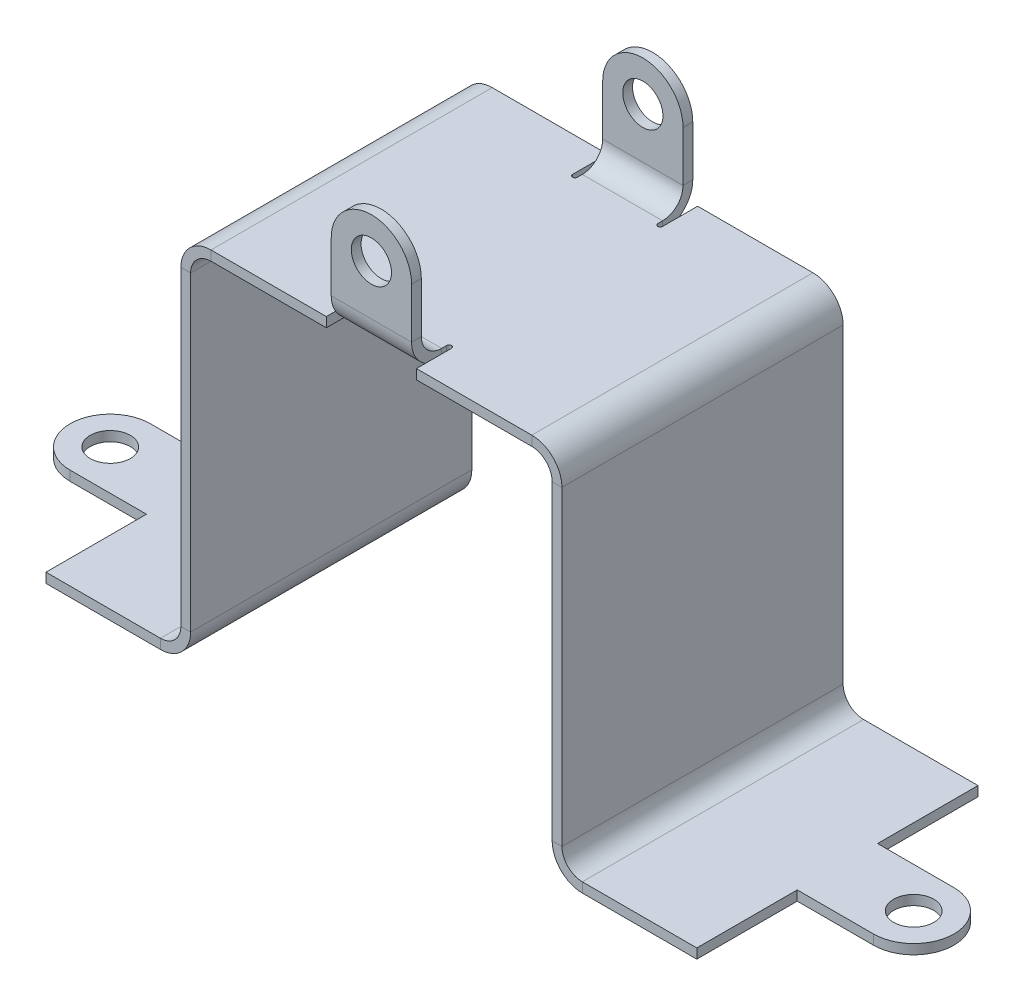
ISO-10303-21;
HEADER;
FILE_DESCRIPTION(('STEP AP214'),'2;1');
FILE_NAME('part.step','',(''),(''),'','','');
FILE_SCHEMA(('AUTOMOTIVE_DESIGN { 1 0 10303 214 1 1 1 1 }'));
ENDSEC;
DATA;
#1=APPLICATION_CONTEXT('core data for automotive mechanical design processes');
#2=APPLICATION_PROTOCOL_DEFINITION('international standard','automotive_design',2000,#1);
#3=PRODUCT_CONTEXT('',#1,'mechanical');
#4=PRODUCT('Part','Part','',(#3));
#5=PRODUCT_RELATED_PRODUCT_CATEGORY('part','',(#4));
#6=PRODUCT_DEFINITION_FORMATION('','',#4);
#7=PRODUCT_DEFINITION_CONTEXT('part definition',#1,'design');
#8=PRODUCT_DEFINITION('design','',#6,#7);
#9=PRODUCT_DEFINITION_SHAPE('','',#8);
#10=(LENGTH_UNIT() NAMED_UNIT(*) SI_UNIT(.MILLI.,.METRE.));
#11=(NAMED_UNIT(*) PLANE_ANGLE_UNIT() SI_UNIT($,.RADIAN.));
#12=(NAMED_UNIT(*) SI_UNIT($,.STERADIAN.) SOLID_ANGLE_UNIT());
#13=UNCERTAINTY_MEASURE_WITH_UNIT(LENGTH_MEASURE(1.E-05),#10,'distance_accuracy_value','');
#14=(GEOMETRIC_REPRESENTATION_CONTEXT(3) GLOBAL_UNCERTAINTY_ASSIGNED_CONTEXT((#13)) GLOBAL_UNIT_ASSIGNED_CONTEXT((#10,
#11,#12)) REPRESENTATION_CONTEXT('',''));
#15=CARTESIAN_POINT('',(0.,0.,0.));
#16=DIRECTION('',(0.,0.,1.));
#17=DIRECTION('',(1.,0.,0.));
#18=AXIS2_PLACEMENT_3D('',#15,#16,#17);
#19=CARTESIAN_POINT('',(-22.5,46.21412,17.5));
#20=DIRECTION('',(0.,1.,0.));
#21=DIRECTION('',(-1.,0.,0.));
#22=AXIS2_PLACEMENT_3D('',#19,#20,#21);
#23=PLANE('',#22);
#24=CARTESIAN_POINT('',(-5.30353000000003,46.21412,-13.13882));
#25=DIRECTION('',(0.,1.,0.));
#26=DIRECTION('',(-1.,0.,0.));
#27=AXIS2_PLACEMENT_3D('',#24,#25,#26);
#28=CIRCLE('',#27,0.30353);
#29=CARTESIAN_POINT('',(-5.60706000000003,46.21412,-13.13882));
#30=VERTEX_POINT('',#29);
#31=CARTESIAN_POINT('',(-5.00000000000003,46.21412,-13.13882));
#32=VERTEX_POINT('',#31);
#33=EDGE_CURVE('E473',#30,#32,#28,.T.);
#34=ORIENTED_EDGE('',*,*,#33,.F.);
#35=DIRECTION('',(0.,0.,1.));
#36=VECTOR('',#35,1.);
#37=CARTESIAN_POINT('',(-5.60706000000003,46.21412,-17.5));
#38=LINE('',#37,#36);
#39=CARTESIAN_POINT('',(-5.60706000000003,46.21412,-17.5));
#40=VERTEX_POINT('',#39);
#41=EDGE_CURVE('E468',#40,#30,#38,.T.);
#42=ORIENTED_EDGE('',*,*,#41,.F.);
#43=DIRECTION('',(1.,0.,0.));
#44=VECTOR('',#43,1.);
#45=CARTESIAN_POINT('',(-22.5,46.21412,-17.5));
#46=LINE('',#45,#44);
#47=CARTESIAN_POINT('',(-19.96,46.21412,-17.5));
#48=VERTEX_POINT('',#47);
#49=EDGE_CURVE('E719',#48,#40,#46,.T.);
#50=ORIENTED_EDGE('',*,*,#49,.F.);
#51=DIRECTION('',(0.,0.,-1.));
#52=VECTOR('',#51,1.);
#53=CARTESIAN_POINT('',(-19.96,46.21412,17.5));
#54=LINE('',#53,#52);
#55=CARTESIAN_POINT('',(-19.96,46.21412,17.5));
#56=VERTEX_POINT('',#55);
#57=EDGE_CURVE('E801',#56,#48,#54,.T.);
#58=ORIENTED_EDGE('',*,*,#57,.F.);
#59=DIRECTION('',(1.,0.,0.));
#60=VECTOR('',#59,1.);
#61=CARTESIAN_POINT('',(-22.5,46.21412,17.5));
#62=LINE('',#61,#60);
#63=CARTESIAN_POINT('',(-5.60706000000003,46.21412,17.5));
#64=VERTEX_POINT('',#63);
#65=EDGE_CURVE('E657',#56,#64,#62,.T.);
#66=ORIENTED_EDGE('',*,*,#65,.T.);
#67=DIRECTION('',(0.,0.,1.));
#68=VECTOR('',#67,1.);
#69=CARTESIAN_POINT('',(-5.60706000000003,46.21412,13.13882));
#70=LINE('',#69,#68);
#71=CARTESIAN_POINT('',(-5.60706000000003,46.21412,13.13882));
#72=VERTEX_POINT('',#71);
#73=EDGE_CURVE('E574',#72,#64,#70,.T.);
#74=ORIENTED_EDGE('',*,*,#73,.F.);
#75=CARTESIAN_POINT('',(-5.30353000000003,46.21412,13.13882));
#76=DIRECTION('',(0.,1.,0.));
#77=DIRECTION('',(-1.,0.,0.));
#78=AXIS2_PLACEMENT_3D('',#75,#76,#77);
#79=CIRCLE('',#78,0.30353);
#80=CARTESIAN_POINT('',(-5.00000000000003,46.21412,13.13882));
#81=VERTEX_POINT('',#80);
#82=EDGE_CURVE('E570',#81,#72,#79,.T.);
#83=ORIENTED_EDGE('',*,*,#82,.F.);
#84=DIRECTION('',(0.,0.,-1.));
#85=VECTOR('',#84,1.);
#86=CARTESIAN_POINT('',(-5.00000000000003,46.21412,13.74588));
#87=LINE('',#86,#85);
#88=CARTESIAN_POINT('',(-5.00000000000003,46.21412,13.74588));
#89=VERTEX_POINT('',#88);
#90=EDGE_CURVE('E567',#89,#81,#87,.T.);
#91=ORIENTED_EDGE('',*,*,#90,.F.);
#92=DIRECTION('',(1.,0.,0.));
#93=VECTOR('',#92,1.);
#94=CARTESIAN_POINT('',(4.99999999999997,46.21412,13.74588));
#95=LINE('',#94,#93);
#96=CARTESIAN_POINT('',(4.99999999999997,46.21412,13.74588));
#97=VERTEX_POINT('',#96);
#98=EDGE_CURVE('E546',#97,#89,#95,.F.);
#99=ORIENTED_EDGE('',*,*,#98,.F.);
#100=DIRECTION('',(0.,0.,1.));
#101=VECTOR('',#100,1.);
#102=CARTESIAN_POINT('',(4.99999999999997,46.21412,13.13882));
#103=LINE('',#102,#101);
#104=CARTESIAN_POINT('',(4.99999999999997,46.21412,13.13882));
#105=VERTEX_POINT('',#104);
#106=EDGE_CURVE('E563',#105,#97,#103,.T.);
#107=ORIENTED_EDGE('',*,*,#106,.F.);
#108=CARTESIAN_POINT('',(5.30352999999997,46.21412,13.13882));
#109=DIRECTION('',(0.,1.,0.));
#110=DIRECTION('',(-1.,0.,0.));
#111=AXIS2_PLACEMENT_3D('',#108,#109,#110);
#112=CIRCLE('',#111,0.30353);
#113=CARTESIAN_POINT('',(5.60705999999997,46.21412,13.13882));
#114=VERTEX_POINT('',#113);
#115=EDGE_CURVE('E95',#114,#105,#112,.T.);
#116=ORIENTED_EDGE('',*,*,#115,.F.);
#117=DIRECTION('',(0.,0.,-1.));
#118=VECTOR('',#117,1.);
#119=CARTESIAN_POINT('',(5.60705999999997,46.21412,17.5));
#120=LINE('',#119,#118);
#121=CARTESIAN_POINT('',(5.60705999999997,46.21412,17.5));
#122=VERTEX_POINT('',#121);
#123=EDGE_CURVE('E556',#122,#114,#120,.T.);
#124=ORIENTED_EDGE('',*,*,#123,.F.);
#125=CARTESIAN_POINT('',(19.9599999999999,46.21412,17.5));
#126=VERTEX_POINT('',#125);
#127=EDGE_CURVE('E656',#122,#126,#62,.T.);
#128=ORIENTED_EDGE('',*,*,#127,.T.);
#129=DIRECTION('',(0.,0.,-1.));
#130=VECTOR('',#129,1.);
#131=CARTESIAN_POINT('',(19.9599999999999,46.21412,17.5));
#132=LINE('',#131,#130);
#133=CARTESIAN_POINT('',(19.9599999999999,46.21412,-17.5));
#134=VERTEX_POINT('',#133);
#135=EDGE_CURVE('E804',#126,#134,#132,.T.);
#136=ORIENTED_EDGE('',*,*,#135,.T.);
#137=CARTESIAN_POINT('',(5.60705999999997,46.21412,-17.5));
#138=VERTEX_POINT('',#137);
#139=EDGE_CURVE('E718',#138,#134,#46,.T.);
#140=ORIENTED_EDGE('',*,*,#139,.F.);
#141=DIRECTION('',(0.,0.,-1.));
#142=VECTOR('',#141,1.);
#143=CARTESIAN_POINT('',(5.60705999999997,46.21412,-13.13882));
#144=LINE('',#143,#142);
#145=CARTESIAN_POINT('',(5.60705999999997,46.21412,-13.13882));
#146=VERTEX_POINT('',#145);
#147=EDGE_CURVE('E87',#146,#138,#144,.T.);
#148=ORIENTED_EDGE('',*,*,#147,.F.);
#149=CARTESIAN_POINT('',(5.30352999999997,46.21412,-13.13882));
#150=DIRECTION('',(0.,1.,0.));
#151=DIRECTION('',(-1.,0.,0.));
#152=AXIS2_PLACEMENT_3D('',#149,#150,#151);
#153=CIRCLE('',#152,0.30353);
#154=CARTESIAN_POINT('',(4.99999999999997,46.21412,-13.13882));
#155=VERTEX_POINT('',#154);
#156=EDGE_CURVE('E483',#155,#146,#153,.T.);
#157=ORIENTED_EDGE('',*,*,#156,.F.);
#158=DIRECTION('',(0.,0.,1.));
#159=VECTOR('',#158,1.);
#160=CARTESIAN_POINT('',(4.99999999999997,46.21412,-13.74588));
#161=LINE('',#160,#159);
#162=CARTESIAN_POINT('',(4.99999999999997,46.21412,-13.74588));
#163=VERTEX_POINT('',#162);
#164=EDGE_CURVE('E480',#163,#155,#161,.T.);
#165=ORIENTED_EDGE('',*,*,#164,.F.);
#166=DIRECTION('',(-1.,0.,0.));
#167=VECTOR('',#166,1.);
#168=CARTESIAN_POINT('',(-5.00000000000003,46.21412,-13.74588));
#169=LINE('',#168,#167);
#170=CARTESIAN_POINT('',(-5.00000000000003,46.21412,-13.74588));
#171=VERTEX_POINT('',#170);
#172=EDGE_CURVE('E456',#171,#163,#169,.F.);
#173=ORIENTED_EDGE('',*,*,#172,.F.);
#174=DIRECTION('',(0.,0.,-1.));
#175=VECTOR('',#174,1.);
#176=CARTESIAN_POINT('',(-5.00000000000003,46.21412,-13.13882));
#177=LINE('',#176,#175);
#178=EDGE_CURVE('E477',#32,#171,#177,.T.);
#179=ORIENTED_EDGE('',*,*,#178,.F.);
#180=EDGE_LOOP('',(#34,#42,#50,#58,#66,#74,#83,#91,#99,#107,#116,#124,#128,#136,#140,#148,#157,
#165,#173,#179));
#181=FACE_BOUND('',#180,.T.);
#182=ADVANCED_FACE('F72',(#181),#23,.T.);
#183=CARTESIAN_POINT('',(-22.5,45.,17.5));
#184=DIRECTION('',(0.,1.,0.));
#185=DIRECTION('',(-1.,0.,0.));
#186=AXIS2_PLACEMENT_3D('',#183,#184,#185);
#187=PLANE('',#186);
#188=DIRECTION('',(0.,0.,-1.));
#189=VECTOR('',#188,1.);
#190=CARTESIAN_POINT('',(-5.60706000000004,45.,17.5));
#191=LINE('',#190,#189);
#192=CARTESIAN_POINT('',(-5.60706000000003,45.,-13.13882));
#193=VERTEX_POINT('',#192);
#194=CARTESIAN_POINT('',(-5.60706000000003,45.,-17.5));
#195=VERTEX_POINT('',#194);
#196=EDGE_CURVE('E501',#193,#195,#191,.T.);
#197=ORIENTED_EDGE('',*,*,#196,.F.);
#198=CARTESIAN_POINT('',(-5.30353000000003,45.,-13.13882));
#199=DIRECTION('',(0.,1.,0.));
#200=DIRECTION('',(-1.,0.,0.));
#201=AXIS2_PLACEMENT_3D('',#198,#199,#200);
#202=CIRCLE('',#201,0.30353);
#203=CARTESIAN_POINT('',(-5.00000000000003,45.,-13.13882));
#204=VERTEX_POINT('',#203);
#205=EDGE_CURVE('E13',#204,#193,#202,.F.);
#206=ORIENTED_EDGE('',*,*,#205,.F.);
#207=DIRECTION('',(0.,0.,1.));
#208=VECTOR('',#207,1.);
#209=CARTESIAN_POINT('',(-5.00000000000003,45.,17.5));
#210=LINE('',#209,#208);
#211=CARTESIAN_POINT('',(-5.00000000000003,45.,-13.74588));
#212=VERTEX_POINT('',#211);
#213=EDGE_CURVE('E80',#212,#204,#210,.T.);
#214=ORIENTED_EDGE('',*,*,#213,.F.);
#215=DIRECTION('',(-1.,0.,0.));
#216=VECTOR('',#215,1.);
#217=CARTESIAN_POINT('',(-5.00000000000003,45.,-13.74588));
#218=LINE('',#217,#216);
#219=CARTESIAN_POINT('',(4.99999999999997,45.,-13.74588));
#220=VERTEX_POINT('',#219);
#221=EDGE_CURVE('E443',#212,#220,#218,.F.);
#222=ORIENTED_EDGE('',*,*,#221,.T.);
#223=DIRECTION('',(0.,0.,-1.));
#224=VECTOR('',#223,1.);
#225=CARTESIAN_POINT('',(4.99999999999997,45.,17.5));
#226=LINE('',#225,#224);
#227=CARTESIAN_POINT('',(4.99999999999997,45.,-13.13882));
#228=VERTEX_POINT('',#227);
#229=EDGE_CURVE('E878',#228,#220,#226,.T.);
#230=ORIENTED_EDGE('',*,*,#229,.F.);
#231=CARTESIAN_POINT('',(5.30352999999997,45.,-13.13882));
#232=DIRECTION('',(0.,1.,0.));
#233=DIRECTION('',(-1.,0.,0.));
#234=AXIS2_PLACEMENT_3D('',#231,#232,#233);
#235=CIRCLE('',#234,0.30353);
#236=CARTESIAN_POINT('',(5.60705999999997,45.,-13.13882));
#237=VERTEX_POINT('',#236);
#238=EDGE_CURVE('E876',#237,#228,#235,.F.);
#239=ORIENTED_EDGE('',*,*,#238,.F.);
#240=DIRECTION('',(0.,0.,1.));
#241=VECTOR('',#240,1.);
#242=CARTESIAN_POINT('',(5.60705999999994,45.,17.5));
#243=LINE('',#242,#241);
#244=CARTESIAN_POINT('',(5.60705999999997,45.,-17.5));
#245=VERTEX_POINT('',#244);
#246=EDGE_CURVE('E471',#245,#237,#243,.T.);
#247=ORIENTED_EDGE('',*,*,#246,.F.);
#248=DIRECTION('',(1.,0.,0.));
#249=VECTOR('',#248,1.);
#250=CARTESIAN_POINT('',(-22.5,45.,-17.5));
#251=LINE('',#250,#249);
#252=CARTESIAN_POINT('',(19.96,45.,-17.5));
#253=VERTEX_POINT('',#252);
#254=EDGE_CURVE('E749',#245,#253,#251,.T.);
#255=ORIENTED_EDGE('',*,*,#254,.T.);
#256=DIRECTION('',(0.,0.,-1.));
#257=VECTOR('',#256,1.);
#258=CARTESIAN_POINT('',(19.96,45.,17.5));
#259=LINE('',#258,#257);
#260=CARTESIAN_POINT('',(19.96,45.,17.5));
#261=VERTEX_POINT('',#260);
#262=EDGE_CURVE('E769',#261,#253,#259,.T.);
#263=ORIENTED_EDGE('',*,*,#262,.F.);
#264=DIRECTION('',(1.,0.,0.));
#265=VECTOR('',#264,1.);
#266=CARTESIAN_POINT('',(-22.5,45.,17.5));
#267=LINE('',#266,#265);
#268=CARTESIAN_POINT('',(5.60705999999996,45.,17.5));
#269=VERTEX_POINT('',#268);
#270=EDGE_CURVE('E687',#269,#261,#267,.T.);
#271=ORIENTED_EDGE('',*,*,#270,.F.);
#272=DIRECTION('',(0.,0.,1.));
#273=VECTOR('',#272,1.);
#274=CARTESIAN_POINT('',(5.60705999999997,45.,17.5));
#275=LINE('',#274,#273);
#276=CARTESIAN_POINT('',(5.60705999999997,45.,13.13882));
#277=VERTEX_POINT('',#276);
#278=EDGE_CURVE('E873',#277,#269,#275,.T.);
#279=ORIENTED_EDGE('',*,*,#278,.F.);
#280=CARTESIAN_POINT('',(5.30352999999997,45.,13.13882));
#281=DIRECTION('',(0.,1.,0.));
#282=DIRECTION('',(-1.,0.,0.));
#283=AXIS2_PLACEMENT_3D('',#280,#281,#282);
#284=CIRCLE('',#283,0.30353);
#285=CARTESIAN_POINT('',(4.99999999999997,45.,13.13882));
#286=VERTEX_POINT('',#285);
#287=EDGE_CURVE('E870',#286,#277,#284,.F.);
#288=ORIENTED_EDGE('',*,*,#287,.F.);
#289=DIRECTION('',(0.,0.,-1.));
#290=VECTOR('',#289,1.);
#291=CARTESIAN_POINT('',(4.99999999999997,45.,17.5));
#292=LINE('',#291,#290);
#293=CARTESIAN_POINT('',(4.99999999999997,45.,13.74588));
#294=VERTEX_POINT('',#293);
#295=EDGE_CURVE('E867',#294,#286,#292,.T.);
#296=ORIENTED_EDGE('',*,*,#295,.F.);
#297=DIRECTION('',(1.,0.,0.));
#298=VECTOR('',#297,1.);
#299=CARTESIAN_POINT('',(4.99999999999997,45.,13.74588));
#300=LINE('',#299,#298);
#301=CARTESIAN_POINT('',(-5.00000000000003,45.,13.74588));
#302=VERTEX_POINT('',#301);
#303=EDGE_CURVE('E534',#294,#302,#300,.F.);
#304=ORIENTED_EDGE('',*,*,#303,.T.);
#305=DIRECTION('',(0.,0.,1.));
#306=VECTOR('',#305,1.);
#307=CARTESIAN_POINT('',(-5.00000000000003,45.,17.5));
#308=LINE('',#307,#306);
#309=CARTESIAN_POINT('',(-5.00000000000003,45.,13.13882));
#310=VERTEX_POINT('',#309);
#311=EDGE_CURVE('E864',#310,#302,#308,.T.);
#312=ORIENTED_EDGE('',*,*,#311,.F.);
#313=CARTESIAN_POINT('',(-5.30353000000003,45.,13.13882));
#314=DIRECTION('',(0.,1.,0.));
#315=DIRECTION('',(-1.,0.,0.));
#316=AXIS2_PLACEMENT_3D('',#313,#314,#315);
#317=CIRCLE('',#316,0.30353);
#318=CARTESIAN_POINT('',(-5.60706000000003,45.,13.13882));
#319=VERTEX_POINT('',#318);
#320=EDGE_CURVE('E861',#319,#310,#317,.F.);
#321=ORIENTED_EDGE('',*,*,#320,.F.);
#322=DIRECTION('',(0.,0.,-1.));
#323=VECTOR('',#322,1.);
#324=CARTESIAN_POINT('',(-5.60706000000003,45.,17.5));
#325=LINE('',#324,#323);
#326=CARTESIAN_POINT('',(-5.60706000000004,45.,17.5));
#327=VERTEX_POINT('',#326);
#328=EDGE_CURVE('E858',#327,#319,#325,.T.);
#329=ORIENTED_EDGE('',*,*,#328,.F.);
#330=CARTESIAN_POINT('',(-19.96,45.,17.5));
#331=VERTEX_POINT('',#330);
#332=EDGE_CURVE('E688',#331,#327,#267,.T.);
#333=ORIENTED_EDGE('',*,*,#332,.F.);
#334=DIRECTION('',(0.,0.,-1.));
#335=VECTOR('',#334,1.);
#336=CARTESIAN_POINT('',(-19.96,45.,17.5));
#337=LINE('',#336,#335);
#338=CARTESIAN_POINT('',(-19.96,45.,-17.5));
#339=VERTEX_POINT('',#338);
#340=EDGE_CURVE('E772',#331,#339,#337,.T.);
#341=ORIENTED_EDGE('',*,*,#340,.T.);
#342=EDGE_CURVE('E750',#339,#195,#251,.T.);
#343=ORIENTED_EDGE('',*,*,#342,.T.);
#344=EDGE_LOOP('',(#197,#206,#214,#222,#230,#239,#247,#255,#263,#271,#279,#288,#296,#304,#312,
#321,#329,#333,#341,#343));
#345=FACE_BOUND('',#344,.T.);
#346=ADVANCED_FACE('F890',(#345),#187,.F.);
#347=CARTESIAN_POINT('',(-23.71412,42.46,-17.5));
#348=DIRECTION('',(0.,0.,-1.));
#349=DIRECTION('',(-1.,0.,0.));
#350=AXIS2_PLACEMENT_3D('',#347,#348,#349);
#351=PLANE('',#350);
#352=ORIENTED_EDGE('',*,*,#49,.T.);
#353=DIRECTION('',(0.,-1.,0.));
#354=VECTOR('',#353,1.);
#355=CARTESIAN_POINT('',(-5.60706000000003,46.21412,-17.5));
#356=LINE('',#355,#354);
#357=EDGE_CURVE('E472',#40,#195,#356,.T.);
#358=ORIENTED_EDGE('',*,*,#357,.T.);
#359=ORIENTED_EDGE('',*,*,#342,.F.);
#360=DIRECTION('',(0.,1.,0.));
#361=VECTOR('',#360,1.);
#362=CARTESIAN_POINT('',(-19.96,45.,-17.5));
#363=LINE('',#362,#361);
#364=EDGE_CURVE('E844',#339,#48,#363,.T.);
#365=ORIENTED_EDGE('',*,*,#364,.T.);
#366=EDGE_LOOP('',(#352,#358,#359,#365));
#367=FACE_BOUND('',#366,.T.);
#368=ADVANCED_FACE('F896',(#367),#351,.T.);
#369=ORIENTED_EDGE('',*,*,#254,.F.);
#370=DIRECTION('',(0.,-1.,0.));
#371=VECTOR('',#370,1.);
#372=CARTESIAN_POINT('',(5.60705999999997,46.21412,-17.5));
#373=LINE('',#372,#371);
#374=EDGE_CURVE('E488',#138,#245,#373,.T.);
#375=ORIENTED_EDGE('',*,*,#374,.F.);
#376=ORIENTED_EDGE('',*,*,#139,.T.);
#377=DIRECTION('',(0.,-1.,0.));
#378=VECTOR('',#377,1.);
#379=CARTESIAN_POINT('',(19.9599999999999,46.21412,-17.5));
#380=LINE('',#379,#378);
#381=EDGE_CURVE('E832',#134,#253,#380,.T.);
#382=ORIENTED_EDGE('',*,*,#381,.T.);
#383=EDGE_LOOP('',(#369,#375,#376,#382));
#384=FACE_BOUND('',#383,.T.);
#385=ADVANCED_FACE('F1073',(#384),#351,.T.);
#386=CARTESIAN_POINT('',(23.71412,42.46,17.5));
#387=DIRECTION('',(0.,0.,1.));
#388=DIRECTION('',(1.,0.,0.));
#389=AXIS2_PLACEMENT_3D('',#386,#387,#388);
#390=PLANE('',#389);
#391=ORIENTED_EDGE('',*,*,#127,.F.);
#392=DIRECTION('',(0.,-1.,0.));
#393=VECTOR('',#392,1.);
#394=CARTESIAN_POINT('',(5.60705999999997,46.21412,17.5));
#395=LINE('',#394,#393);
#396=EDGE_CURVE('E560',#122,#269,#395,.T.);
#397=ORIENTED_EDGE('',*,*,#396,.T.);
#398=ORIENTED_EDGE('',*,*,#270,.T.);
#399=DIRECTION('',(0.,1.,0.));
#400=VECTOR('',#399,1.);
#401=CARTESIAN_POINT('',(19.96,45.,17.5));
#402=LINE('',#401,#400);
#403=EDGE_CURVE('E839',#261,#126,#402,.T.);
#404=ORIENTED_EDGE('',*,*,#403,.T.);
#405=EDGE_LOOP('',(#391,#397,#398,#404));
#406=FACE_BOUND('',#405,.T.);
#407=ADVANCED_FACE('F1070',(#406),#390,.T.);
#408=ORIENTED_EDGE('',*,*,#332,.T.);
#409=DIRECTION('',(0.,-1.,0.));
#410=VECTOR('',#409,1.);
#411=CARTESIAN_POINT('',(-5.60706000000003,46.21412,17.5));
#412=LINE('',#411,#410);
#413=EDGE_CURVE('E577',#64,#327,#412,.T.);
#414=ORIENTED_EDGE('',*,*,#413,.F.);
#415=ORIENTED_EDGE('',*,*,#65,.F.);
#416=DIRECTION('',(0.,-1.,0.));
#417=VECTOR('',#416,1.);
#418=CARTESIAN_POINT('',(-19.96,46.21412,17.5));
#419=LINE('',#418,#417);
#420=EDGE_CURVE('E846',#56,#331,#419,.T.);
#421=ORIENTED_EDGE('',*,*,#420,.T.);
#422=EDGE_LOOP('',(#408,#414,#415,#421));
#423=FACE_BOUND('',#422,.T.);
#424=ADVANCED_FACE('F959',(#423),#390,.T.);
#425=CARTESIAN_POINT('',(-40.5,0.,17.5));
#426=DIRECTION('',(-1.,0.,0.));
#427=DIRECTION('',(0.,0.,1.));
#428=AXIS2_PLACEMENT_3D('',#425,#426,#427);
#429=PLANE('',#428);
#430=DIRECTION('',(0.,0.,-1.));
#431=VECTOR('',#430,1.);
#432=CARTESIAN_POINT('',(-40.5,0.,17.5));
#433=LINE('',#432,#431);
#434=CARTESIAN_POINT('',(-40.5,0.,-5.));
#435=VERTEX_POINT('',#434);
#436=CARTESIAN_POINT('',(-40.5,0.,-17.5));
#437=VERTEX_POINT('',#436);
#438=EDGE_CURVE('E784',#435,#437,#433,.T.);
#439=ORIENTED_EDGE('',*,*,#438,.F.);
#440=DIRECTION('',(0.,1.,0.));
#441=VECTOR('',#440,1.);
#442=CARTESIAN_POINT('',(-40.5,0.,-5.));
#443=LINE('',#442,#441);
#444=CARTESIAN_POINT('',(-40.5,1.21412,-5.));
#445=VERTEX_POINT('',#444);
#446=EDGE_CURVE('E601',#435,#445,#443,.T.);
#447=ORIENTED_EDGE('',*,*,#446,.T.);
#448=DIRECTION('',(0.,0.,-1.));
#449=VECTOR('',#448,1.);
#450=CARTESIAN_POINT('',(-40.5,1.21412,17.5));
#451=LINE('',#450,#449);
#452=CARTESIAN_POINT('',(-40.5,1.21412,-17.5));
#453=VERTEX_POINT('',#452);
#454=EDGE_CURVE('E788',#445,#453,#451,.T.);
#455=ORIENTED_EDGE('',*,*,#454,.T.);
#456=DIRECTION('',(0.,1.,0.));
#457=VECTOR('',#456,1.);
#458=CARTESIAN_POINT('',(-40.5,0.,-17.5));
#459=LINE('',#458,#457);
#460=EDGE_CURVE('E734',#437,#453,#459,.T.);
#461=ORIENTED_EDGE('',*,*,#460,.F.);
#462=EDGE_LOOP('',(#439,#447,#455,#461));
#463=FACE_BOUND('',#462,.T.);
#464=ADVANCED_FACE('F1096',(#463),#429,.T.);
#465=CARTESIAN_POINT('',(40.5,1.21412000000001,17.5));
#466=DIRECTION('',(1.,0.,0.));
#467=DIRECTION('',(0.,0.,-1.));
#468=AXIS2_PLACEMENT_3D('',#465,#466,#467);
#469=PLANE('',#468);
#470=DIRECTION('',(0.,0.,-1.));
#471=VECTOR('',#470,1.);
#472=CARTESIAN_POINT('',(40.5,0.,17.5));
#473=LINE('',#472,#471);
#474=CARTESIAN_POINT('',(40.5,0.,17.5));
#475=VERTEX_POINT('',#474);
#476=CARTESIAN_POINT('',(40.5,0.,5.));
#477=VERTEX_POINT('',#476);
#478=EDGE_CURVE('E821',#475,#477,#473,.T.);
#479=ORIENTED_EDGE('',*,*,#478,.T.);
#480=DIRECTION('',(0.,1.,0.));
#481=VECTOR('',#480,1.);
#482=CARTESIAN_POINT('',(40.5,0.,5.));
#483=LINE('',#482,#481);
#484=CARTESIAN_POINT('',(40.5,1.21412000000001,5.));
#485=VERTEX_POINT('',#484);
#486=EDGE_CURVE('E634',#477,#485,#483,.T.);
#487=ORIENTED_EDGE('',*,*,#486,.T.);
#488=DIRECTION('',(0.,0.,-1.));
#489=VECTOR('',#488,1.);
#490=CARTESIAN_POINT('',(40.5,1.21412000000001,17.5));
#491=LINE('',#490,#489);
#492=CARTESIAN_POINT('',(40.5,1.21412000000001,17.5));
#493=VERTEX_POINT('',#492);
#494=EDGE_CURVE('E817',#493,#485,#491,.T.);
#495=ORIENTED_EDGE('',*,*,#494,.F.);
#496=DIRECTION('',(0.,-1.,0.));
#497=VECTOR('',#496,1.);
#498=CARTESIAN_POINT('',(40.5,1.21412000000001,17.5));
#499=LINE('',#498,#497);
#500=EDGE_CURVE('E640',#493,#475,#499,.T.);
#501=ORIENTED_EDGE('',*,*,#500,.T.);
#502=EDGE_LOOP('',(#479,#487,#495,#501));
#503=FACE_BOUND('',#502,.T.);
#504=ADVANCED_FACE('F1041',(#503),#469,.T.);
#505=CARTESIAN_POINT('',(-26.25412,0.,17.5));
#506=DIRECTION('',(0.,0.,1.));
#507=DIRECTION('',(1.,0.,0.));
#508=AXIS2_PLACEMENT_3D('',#505,#506,#507);
#509=PLANE('',#508);
#510=DIRECTION('',(0.,1.,0.));
#511=VECTOR('',#510,1.);
#512=CARTESIAN_POINT('',(-26.25412,0.,17.5));
#513=LINE('',#512,#511);
#514=CARTESIAN_POINT('',(-26.25412,0.,17.5));
#515=VERTEX_POINT('',#514);
#516=CARTESIAN_POINT('',(-26.25412,1.21412,17.5));
#517=VERTEX_POINT('',#516);
#518=EDGE_CURVE('E856',#515,#517,#513,.T.);
#519=ORIENTED_EDGE('',*,*,#518,.F.);
#520=CARTESIAN_POINT('',(-26.25412,3.75412,17.5));
#521=DIRECTION('',(0.,0.,-1.));
#522=DIRECTION('',(-1.,0.,0.));
#523=AXIS2_PLACEMENT_3D('',#520,#521,#522);
#524=CIRCLE('',#523,3.75412);
#525=CARTESIAN_POINT('',(-22.5,3.75412,17.5));
#526=VERTEX_POINT('',#525);
#527=EDGE_CURVE('E678',#515,#526,#524,.F.);
#528=ORIENTED_EDGE('',*,*,#527,.T.);
#529=DIRECTION('',(1.,0.,0.));
#530=VECTOR('',#529,1.);
#531=CARTESIAN_POINT('',(-23.71412,3.75412,17.5));
#532=LINE('',#531,#530);
#533=CARTESIAN_POINT('',(-23.71412,3.75412,17.5));
#534=VERTEX_POINT('',#533);
#535=EDGE_CURVE('E854',#534,#526,#532,.T.);
#536=ORIENTED_EDGE('',*,*,#535,.F.);
#537=CARTESIAN_POINT('',(-26.25412,3.75412,17.5));
#538=DIRECTION('',(0.,0.,1.));
#539=DIRECTION('',(1.,0.,0.));
#540=AXIS2_PLACEMENT_3D('',#537,#538,#539);
#541=CIRCLE('',#540,2.54);
#542=EDGE_CURVE('E666',#517,#534,#541,.T.);
#543=ORIENTED_EDGE('',*,*,#542,.F.);
#544=EDGE_LOOP('',(#519,#528,#536,#543));
#545=FACE_BOUND('',#544,.T.);
#546=ADVANCED_FACE('F74',(#545),#509,.T.);
#547=CARTESIAN_POINT('',(-23.71412,3.75412,17.5));
#548=DIRECTION('',(0.,0.,1.));
#549=DIRECTION('',(1.,0.,0.));
#550=AXIS2_PLACEMENT_3D('',#547,#548,#549);
#551=PLANE('',#550);
#552=DIRECTION('',(1.,0.,0.));
#553=VECTOR('',#552,1.);
#554=CARTESIAN_POINT('',(-40.5,0.,17.5));
#555=LINE('',#554,#553);
#556=CARTESIAN_POINT('',(-40.5,0.,17.5));
#557=VERTEX_POINT('',#556);
#558=EDGE_CURVE('E675',#557,#515,#555,.T.);
#559=ORIENTED_EDGE('',*,*,#558,.T.);
#560=ORIENTED_EDGE('',*,*,#518,.T.);
#561=DIRECTION('',(1.,0.,0.));
#562=VECTOR('',#561,1.);
#563=CARTESIAN_POINT('',(-40.5,1.21412,17.5));
#564=LINE('',#563,#562);
#565=CARTESIAN_POINT('',(-40.5,1.21412,17.5));
#566=VERTEX_POINT('',#565);
#567=EDGE_CURVE('E669',#566,#517,#564,.T.);
#568=ORIENTED_EDGE('',*,*,#567,.F.);
#569=DIRECTION('',(0.,1.,0.));
#570=VECTOR('',#569,1.);
#571=CARTESIAN_POINT('',(-40.5,0.,17.5));
#572=LINE('',#571,#570);
#573=EDGE_CURVE('E672',#557,#566,#572,.T.);
#574=ORIENTED_EDGE('',*,*,#573,.F.);
#575=EDGE_LOOP('',(#559,#560,#568,#574));
#576=FACE_BOUND('',#575,.T.);
#577=ADVANCED_FACE('F937',(#576),#551,.T.);
#578=CARTESIAN_POINT('',(-22.5,3.75412,-17.5));
#579=DIRECTION('',(0.,0.,-1.));
#580=DIRECTION('',(-1.,0.,0.));
#581=AXIS2_PLACEMENT_3D('',#578,#579,#580);
#582=PLANE('',#581);
#583=DIRECTION('',(-1.,0.,0.));
#584=VECTOR('',#583,1.);
#585=CARTESIAN_POINT('',(-22.5,3.75412,-17.5));
#586=LINE('',#585,#584);
#587=CARTESIAN_POINT('',(-22.5,3.75412,-17.5));
#588=VERTEX_POINT('',#587);
#589=CARTESIAN_POINT('',(-23.71412,3.75412,-17.5));
#590=VERTEX_POINT('',#589);
#591=EDGE_CURVE('E852',#588,#590,#586,.T.);
#592=ORIENTED_EDGE('',*,*,#591,.F.);
#593=CARTESIAN_POINT('',(-26.25412,3.75412,-17.5));
#594=DIRECTION('',(0.,0.,-1.));
#595=DIRECTION('',(-1.,0.,0.));
#596=AXIS2_PLACEMENT_3D('',#593,#594,#595);
#597=CIRCLE('',#596,3.75412);
#598=CARTESIAN_POINT('',(-26.25412,0.,-17.5));
#599=VERTEX_POINT('',#598);
#600=EDGE_CURVE('E740',#599,#588,#597,.F.);
#601=ORIENTED_EDGE('',*,*,#600,.F.);
#602=DIRECTION('',(0.,-1.,0.));
#603=VECTOR('',#602,1.);
#604=CARTESIAN_POINT('',(-26.25412,1.21412,-17.5));
#605=LINE('',#604,#603);
#606=CARTESIAN_POINT('',(-26.25412,1.21412,-17.5));
#607=VERTEX_POINT('',#606);
#608=EDGE_CURVE('E850',#607,#599,#605,.T.);
#609=ORIENTED_EDGE('',*,*,#608,.F.);
#610=CARTESIAN_POINT('',(-26.25412,3.75412,-17.5));
#611=DIRECTION('',(0.,0.,1.));
#612=DIRECTION('',(1.,0.,0.));
#613=AXIS2_PLACEMENT_3D('',#610,#611,#612);
#614=CIRCLE('',#613,2.54);
#615=EDGE_CURVE('E728',#607,#590,#614,.T.);
#616=ORIENTED_EDGE('',*,*,#615,.T.);
#617=EDGE_LOOP('',(#592,#601,#609,#616));
#618=FACE_BOUND('',#617,.T.);
#619=ADVANCED_FACE('F918',(#618),#582,.T.);
#620=CARTESIAN_POINT('',(-26.25412,1.21412,-17.5));
#621=DIRECTION('',(0.,0.,-1.));
#622=DIRECTION('',(-1.,0.,0.));
#623=AXIS2_PLACEMENT_3D('',#620,#621,#622);
#624=PLANE('',#623);
#625=DIRECTION('',(0.,1.,0.));
#626=VECTOR('',#625,1.);
#627=CARTESIAN_POINT('',(-22.5,0.,-17.5));
#628=LINE('',#627,#626);
#629=CARTESIAN_POINT('',(-22.5,42.46,-17.5));
#630=VERTEX_POINT('',#629);
#631=EDGE_CURVE('E743',#588,#630,#628,.T.);
#632=ORIENTED_EDGE('',*,*,#631,.F.);
#633=ORIENTED_EDGE('',*,*,#591,.T.);
#634=DIRECTION('',(0.,1.,0.));
#635=VECTOR('',#634,1.);
#636=CARTESIAN_POINT('',(-23.71412,0.,-17.5));
#637=LINE('',#636,#635);
#638=CARTESIAN_POINT('',(-23.71412,42.46,-17.5));
#639=VERTEX_POINT('',#638);
#640=EDGE_CURVE('E725',#590,#639,#637,.T.);
#641=ORIENTED_EDGE('',*,*,#640,.T.);
#642=DIRECTION('',(1.,0.,0.));
#643=VECTOR('',#642,1.);
#644=CARTESIAN_POINT('',(-23.71412,42.46,-17.5));
#645=LINE('',#644,#643);
#646=EDGE_CURVE('E842',#639,#630,#645,.T.);
#647=ORIENTED_EDGE('',*,*,#646,.T.);
#648=EDGE_LOOP('',(#632,#633,#641,#647));
#649=FACE_BOUND('',#648,.T.);
#650=ADVANCED_FACE('F911',(#649),#624,.T.);
#651=CARTESIAN_POINT('',(-22.5,42.46,17.5));
#652=DIRECTION('',(0.,0.,1.));
#653=DIRECTION('',(1.,0.,0.));
#654=AXIS2_PLACEMENT_3D('',#651,#652,#653);
#655=PLANE('',#654);
#656=DIRECTION('',(-1.,0.,0.));
#657=VECTOR('',#656,1.);
#658=CARTESIAN_POINT('',(-22.5,42.46,17.5));
#659=LINE('',#658,#657);
#660=CARTESIAN_POINT('',(-22.5,42.46,17.5));
#661=VERTEX_POINT('',#660);
#662=CARTESIAN_POINT('',(-23.71412,42.46,17.5));
#663=VERTEX_POINT('',#662);
#664=EDGE_CURVE('E848',#661,#663,#659,.T.);
#665=ORIENTED_EDGE('',*,*,#664,.F.);
#666=CARTESIAN_POINT('',(-19.96,42.46,17.5));
#667=DIRECTION('',(0.,0.,1.));
#668=DIRECTION('',(1.,0.,0.));
#669=AXIS2_PLACEMENT_3D('',#666,#667,#668);
#670=CIRCLE('',#669,2.54);
#671=EDGE_CURVE('E684',#661,#331,#670,.F.);
#672=ORIENTED_EDGE('',*,*,#671,.T.);
#673=ORIENTED_EDGE('',*,*,#420,.F.);
#674=CARTESIAN_POINT('',(-19.96,42.46,17.5));
#675=DIRECTION('',(0.,0.,1.));
#676=DIRECTION('',(1.,0.,0.));
#677=AXIS2_PLACEMENT_3D('',#674,#675,#676);
#678=CIRCLE('',#677,3.75412);
#679=EDGE_CURVE('E660',#663,#56,#678,.F.);
#680=ORIENTED_EDGE('',*,*,#679,.F.);
#681=EDGE_LOOP('',(#665,#672,#673,#680));
#682=FACE_BOUND('',#681,.T.);
#683=ADVANCED_FACE('F955',(#682),#655,.T.);
#684=CARTESIAN_POINT('',(-19.96,46.21412,17.5));
#685=DIRECTION('',(0.,0.,1.));
#686=DIRECTION('',(1.,0.,0.));
#687=AXIS2_PLACEMENT_3D('',#684,#685,#686);
#688=PLANE('',#687);
#689=DIRECTION('',(0.,1.,0.));
#690=VECTOR('',#689,1.);
#691=CARTESIAN_POINT('',(-22.5,0.,17.5));
#692=LINE('',#691,#690);
#693=EDGE_CURVE('E681',#526,#661,#692,.T.);
#694=ORIENTED_EDGE('',*,*,#693,.T.);
#695=ORIENTED_EDGE('',*,*,#664,.T.);
#696=DIRECTION('',(0.,1.,0.));
#697=VECTOR('',#696,1.);
#698=CARTESIAN_POINT('',(-23.71412,0.,17.5));
#699=LINE('',#698,#697);
#700=EDGE_CURVE('E663',#534,#663,#699,.T.);
#701=ORIENTED_EDGE('',*,*,#700,.F.);
#702=ORIENTED_EDGE('',*,*,#535,.T.);
#703=EDGE_LOOP('',(#694,#695,#701,#702));
#704=FACE_BOUND('',#703,.T.);
#705=ADVANCED_FACE('F952',(#704),#688,.T.);
#706=CARTESIAN_POINT('',(-19.96,45.,-17.5));
#707=DIRECTION('',(0.,0.,-1.));
#708=DIRECTION('',(-1.,0.,0.));
#709=AXIS2_PLACEMENT_3D('',#706,#707,#708);
#710=PLANE('',#709);
#711=ORIENTED_EDGE('',*,*,#364,.F.);
#712=CARTESIAN_POINT('',(-19.96,42.46,-17.5));
#713=DIRECTION('',(0.,0.,1.));
#714=DIRECTION('',(1.,0.,0.));
#715=AXIS2_PLACEMENT_3D('',#712,#713,#714);
#716=CIRCLE('',#715,2.54);
#717=EDGE_CURVE('E746',#630,#339,#716,.F.);
#718=ORIENTED_EDGE('',*,*,#717,.F.);
#719=ORIENTED_EDGE('',*,*,#646,.F.);
#720=CARTESIAN_POINT('',(-19.96,42.46,-17.5));
#721=DIRECTION('',(0.,0.,1.));
#722=DIRECTION('',(1.,0.,0.));
#723=AXIS2_PLACEMENT_3D('',#720,#721,#722);
#724=CIRCLE('',#723,3.75412);
#725=EDGE_CURVE('E722',#639,#48,#724,.F.);
#726=ORIENTED_EDGE('',*,*,#725,.T.);
#727=EDGE_LOOP('',(#711,#718,#719,#726));
#728=FACE_BOUND('',#727,.T.);
#729=ADVANCED_FACE('F902',(#728),#710,.T.);
#730=CARTESIAN_POINT('',(19.96,45.,17.5));
#731=DIRECTION('',(0.,0.,1.));
#732=DIRECTION('',(1.,0.,0.));
#733=AXIS2_PLACEMENT_3D('',#730,#731,#732);
#734=PLANE('',#733);
#735=ORIENTED_EDGE('',*,*,#403,.F.);
#736=CARTESIAN_POINT('',(19.96,42.46,17.5));
#737=DIRECTION('',(0.,0.,1.));
#738=DIRECTION('',(1.,0.,0.));
#739=AXIS2_PLACEMENT_3D('',#736,#737,#738);
#740=CIRCLE('',#739,2.54);
#741=CARTESIAN_POINT('',(22.5,42.46,17.5));
#742=VERTEX_POINT('',#741);
#743=EDGE_CURVE('E691',#261,#742,#740,.F.);
#744=ORIENTED_EDGE('',*,*,#743,.T.);
#745=DIRECTION('',(-1.,0.,0.));
#746=VECTOR('',#745,1.);
#747=CARTESIAN_POINT('',(23.71412,42.46,17.5));
#748=LINE('',#747,#746);
#749=CARTESIAN_POINT('',(23.71412,42.46,17.5));
#750=VERTEX_POINT('',#749);
#751=EDGE_CURVE('E837',#750,#742,#748,.T.);
#752=ORIENTED_EDGE('',*,*,#751,.F.);
#753=CARTESIAN_POINT('',(19.96,42.46,17.5));
#754=DIRECTION('',(0.,0.,1.));
#755=DIRECTION('',(1.,0.,0.));
#756=AXIS2_PLACEMENT_3D('',#753,#754,#755);
#757=CIRCLE('',#756,3.75412);
#758=EDGE_CURVE('E653',#126,#750,#757,.F.);
#759=ORIENTED_EDGE('',*,*,#758,.F.);
#760=EDGE_LOOP('',(#735,#744,#752,#759));
#761=FACE_BOUND('',#760,.T.);
#762=ADVANCED_FACE('F1068',(#761),#734,.T.);
#763=CARTESIAN_POINT('',(22.5,42.46,-17.5));
#764=DIRECTION('',(0.,0.,-1.));
#765=DIRECTION('',(-1.,0.,0.));
#766=AXIS2_PLACEMENT_3D('',#763,#764,#765);
#767=PLANE('',#766);
#768=DIRECTION('',(1.,0.,0.));
#769=VECTOR('',#768,1.);
#770=CARTESIAN_POINT('',(22.5,42.46,-17.5));
#771=LINE('',#770,#769);
#772=CARTESIAN_POINT('',(22.5,42.46,-17.5));
#773=VERTEX_POINT('',#772);
#774=CARTESIAN_POINT('',(23.71412,42.46,-17.5));
#775=VERTEX_POINT('',#774);
#776=EDGE_CURVE('E835',#773,#775,#771,.T.);
#777=ORIENTED_EDGE('',*,*,#776,.F.);
#778=CARTESIAN_POINT('',(19.96,42.46,-17.5));
#779=DIRECTION('',(0.,0.,1.));
#780=DIRECTION('',(1.,0.,0.));
#781=AXIS2_PLACEMENT_3D('',#778,#779,#780);
#782=CIRCLE('',#781,2.54);
#783=EDGE_CURVE('E753',#253,#773,#782,.F.);
#784=ORIENTED_EDGE('',*,*,#783,.F.);
#785=ORIENTED_EDGE('',*,*,#381,.F.);
#786=CARTESIAN_POINT('',(19.96,42.46,-17.5));
#787=DIRECTION('',(0.,0.,1.));
#788=DIRECTION('',(1.,0.,0.));
#789=AXIS2_PLACEMENT_3D('',#786,#787,#788);
#790=CIRCLE('',#789,3.75412);
#791=EDGE_CURVE('E715',#134,#775,#790,.F.);
#792=ORIENTED_EDGE('',*,*,#791,.T.);
#793=EDGE_LOOP('',(#777,#784,#785,#792));
#794=FACE_BOUND('',#793,.T.);
#795=ADVANCED_FACE('F1064',(#794),#767,.T.);
#796=CARTESIAN_POINT('',(19.9599999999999,46.21412,-17.5));
#797=DIRECTION('',(0.,0.,-1.));
#798=DIRECTION('',(-1.,0.,0.));
#799=AXIS2_PLACEMENT_3D('',#796,#797,#798);
#800=PLANE('',#799);
#801=DIRECTION('',(0.,-1.,0.));
#802=VECTOR('',#801,1.);
#803=CARTESIAN_POINT('',(22.5,45.,-17.5));
#804=LINE('',#803,#802);
#805=CARTESIAN_POINT('',(22.5,3.75412000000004,-17.5));
#806=VERTEX_POINT('',#805);
#807=EDGE_CURVE('E756',#773,#806,#804,.T.);
#808=ORIENTED_EDGE('',*,*,#807,.F.);
#809=ORIENTED_EDGE('',*,*,#776,.T.);
#810=DIRECTION('',(0.,-1.,0.));
#811=VECTOR('',#810,1.);
#812=CARTESIAN_POINT('',(23.71412,45.,-17.5));
#813=LINE('',#812,#811);
#814=CARTESIAN_POINT('',(23.71412,3.75412000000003,-17.5));
#815=VERTEX_POINT('',#814);
#816=EDGE_CURVE('E712',#775,#815,#813,.T.);
#817=ORIENTED_EDGE('',*,*,#816,.T.);
#818=DIRECTION('',(-1.,0.,0.));
#819=VECTOR('',#818,1.);
#820=CARTESIAN_POINT('',(23.71412,3.75412000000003,-17.5));
#821=LINE('',#820,#819);
#822=EDGE_CURVE('E824',#815,#806,#821,.T.);
#823=ORIENTED_EDGE('',*,*,#822,.T.);
#824=EDGE_LOOP('',(#808,#809,#817,#823));
#825=FACE_BOUND('',#824,.T.);
#826=ADVANCED_FACE('F1060',(#825),#800,.T.);
#827=CARTESIAN_POINT('',(22.5,3.75412000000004,17.5));
#828=DIRECTION('',(0.,0.,1.));
#829=DIRECTION('',(1.,0.,0.));
#830=AXIS2_PLACEMENT_3D('',#827,#828,#829);
#831=PLANE('',#830);
#832=DIRECTION('',(1.,0.,0.));
#833=VECTOR('',#832,1.);
#834=CARTESIAN_POINT('',(22.5,3.75412000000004,17.5));
#835=LINE('',#834,#833);
#836=CARTESIAN_POINT('',(22.5,3.75412000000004,17.5));
#837=VERTEX_POINT('',#836);
#838=CARTESIAN_POINT('',(23.71412,3.75412000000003,17.5));
#839=VERTEX_POINT('',#838);
#840=EDGE_CURVE('E830',#837,#839,#835,.T.);
#841=ORIENTED_EDGE('',*,*,#840,.F.);
#842=CARTESIAN_POINT('',(26.25412,3.75412000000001,17.5));
#843=DIRECTION('',(0.,0.,-1.));
#844=DIRECTION('',(-1.,0.,0.));
#845=AXIS2_PLACEMENT_3D('',#842,#843,#844);
#846=CIRCLE('',#845,3.75412);
#847=CARTESIAN_POINT('',(26.25412,0.,17.5));
#848=VERTEX_POINT('',#847);
#849=EDGE_CURVE('E697',#837,#848,#846,.F.);
#850=ORIENTED_EDGE('',*,*,#849,.T.);
#851=DIRECTION('',(0.,-1.,0.));
#852=VECTOR('',#851,1.);
#853=CARTESIAN_POINT('',(26.25412,1.21412000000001,17.5));
#854=LINE('',#853,#852);
#855=CARTESIAN_POINT('',(26.25412,1.21412000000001,17.5));
#856=VERTEX_POINT('',#855);
#857=EDGE_CURVE('E828',#856,#848,#854,.T.);
#858=ORIENTED_EDGE('',*,*,#857,.F.);
#859=CARTESIAN_POINT('',(26.25412,3.75412000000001,17.5));
#860=DIRECTION('',(0.,0.,1.));
#861=DIRECTION('',(1.,0.,0.));
#862=AXIS2_PLACEMENT_3D('',#859,#860,#861);
#863=CIRCLE('',#862,2.54);
#864=EDGE_CURVE('E647',#839,#856,#863,.T.);
#865=ORIENTED_EDGE('',*,*,#864,.F.);
#866=EDGE_LOOP('',(#841,#850,#858,#865));
#867=FACE_BOUND('',#866,.T.);
#868=ADVANCED_FACE('F1056',(#867),#831,.T.);
#869=CARTESIAN_POINT('',(26.25412,1.21412000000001,17.5));
#870=DIRECTION('',(0.,0.,1.));
#871=DIRECTION('',(1.,0.,0.));
#872=AXIS2_PLACEMENT_3D('',#869,#870,#871);
#873=PLANE('',#872);
#874=DIRECTION('',(0.,-1.,0.));
#875=VECTOR('',#874,1.);
#876=CARTESIAN_POINT('',(22.5,45.,17.5));
#877=LINE('',#876,#875);
#878=EDGE_CURVE('E694',#742,#837,#877,.T.);
#879=ORIENTED_EDGE('',*,*,#878,.T.);
#880=ORIENTED_EDGE('',*,*,#840,.T.);
#881=DIRECTION('',(0.,-1.,0.));
#882=VECTOR('',#881,1.);
#883=CARTESIAN_POINT('',(23.71412,45.,17.5));
#884=LINE('',#883,#882);
#885=EDGE_CURVE('E650',#750,#839,#884,.T.);
#886=ORIENTED_EDGE('',*,*,#885,.F.);
#887=ORIENTED_EDGE('',*,*,#751,.T.);
#888=EDGE_LOOP('',(#879,#880,#886,#887));
#889=FACE_BOUND('',#888,.T.);
#890=ADVANCED_FACE('F1052',(#889),#873,.T.);
#891=CARTESIAN_POINT('',(26.25412,0.,-17.5));
#892=DIRECTION('',(0.,0.,-1.));
#893=DIRECTION('',(-1.,0.,0.));
#894=AXIS2_PLACEMENT_3D('',#891,#892,#893);
#895=PLANE('',#894);
#896=DIRECTION('',(0.,1.,0.));
#897=VECTOR('',#896,1.);
#898=CARTESIAN_POINT('',(26.25412,0.,-17.5));
#899=LINE('',#898,#897);
#900=CARTESIAN_POINT('',(26.25412,0.,-17.5));
#901=VERTEX_POINT('',#900);
#902=CARTESIAN_POINT('',(26.25412,1.21412000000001,-17.5));
#903=VERTEX_POINT('',#902);
#904=EDGE_CURVE('E826',#901,#903,#899,.T.);
#905=ORIENTED_EDGE('',*,*,#904,.F.);
#906=CARTESIAN_POINT('',(26.25412,3.75412000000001,-17.5));
#907=DIRECTION('',(0.,0.,-1.));
#908=DIRECTION('',(-1.,0.,0.));
#909=AXIS2_PLACEMENT_3D('',#906,#907,#908);
#910=CIRCLE('',#909,3.75412);
#911=EDGE_CURVE('E641',#806,#901,#910,.F.);
#912=ORIENTED_EDGE('',*,*,#911,.F.);
#913=ORIENTED_EDGE('',*,*,#822,.F.);
#914=CARTESIAN_POINT('',(26.25412,3.75412000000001,-17.5));
#915=DIRECTION('',(0.,0.,1.));
#916=DIRECTION('',(1.,0.,0.));
#917=AXIS2_PLACEMENT_3D('',#914,#915,#916);
#918=CIRCLE('',#917,2.54);
#919=EDGE_CURVE('E709',#815,#903,#918,.T.);
#920=ORIENTED_EDGE('',*,*,#919,.T.);
#921=EDGE_LOOP('',(#905,#912,#913,#920));
#922=FACE_BOUND('',#921,.T.);
#923=ADVANCED_FACE('F1048',(#922),#895,.T.);
#924=CARTESIAN_POINT('',(23.71412,3.75412000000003,-17.5));
#925=DIRECTION('',(0.,0.,-1.));
#926=DIRECTION('',(-1.,0.,0.));
#927=AXIS2_PLACEMENT_3D('',#924,#925,#926);
#928=PLANE('',#927);
#929=DIRECTION('',(1.,0.,0.));
#930=VECTOR('',#929,1.);
#931=CARTESIAN_POINT('',(22.5,0.,-17.5));
#932=LINE('',#931,#930);
#933=CARTESIAN_POINT('',(40.5,0.,-17.5));
#934=VERTEX_POINT('',#933);
#935=EDGE_CURVE('E631',#901,#934,#932,.T.);
#936=ORIENTED_EDGE('',*,*,#935,.F.);
#937=ORIENTED_EDGE('',*,*,#904,.T.);
#938=DIRECTION('',(1.,0.,0.));
#939=VECTOR('',#938,1.);
#940=CARTESIAN_POINT('',(22.5,1.21412000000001,-17.5));
#941=LINE('',#940,#939);
#942=CARTESIAN_POINT('',(40.5,1.21412000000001,-17.5));
#943=VERTEX_POINT('',#942);
#944=EDGE_CURVE('E706',#903,#943,#941,.T.);
#945=ORIENTED_EDGE('',*,*,#944,.T.);
#946=DIRECTION('',(0.,-1.,0.));
#947=VECTOR('',#946,1.);
#948=CARTESIAN_POINT('',(40.5,1.21412000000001,-17.5));
#949=LINE('',#948,#947);
#950=EDGE_CURVE('E703',#943,#934,#949,.T.);
#951=ORIENTED_EDGE('',*,*,#950,.T.);
#952=EDGE_LOOP('',(#936,#937,#945,#951));
#953=FACE_BOUND('',#952,.T.);
#954=ADVANCED_FACE('F1044',(#953),#928,.T.);
#955=CARTESIAN_POINT('',(22.5,0.,17.5));
#956=DIRECTION('',(0.,1.,0.));
#957=DIRECTION('',(-1.,0.,0.));
#958=AXIS2_PLACEMENT_3D('',#955,#956,#957);
#959=PLANE('',#958);
#960=CARTESIAN_POINT('',(50.,0.,0.));
#961=DIRECTION('',(0.,1.,0.));
#962=DIRECTION('',(-1.,0.,0.));
#963=AXIS2_PLACEMENT_3D('',#960,#961,#962);
#964=CIRCLE('',#963,2.5);
#965=CARTESIAN_POINT('',(47.5,0.,0.));
#966=VERTEX_POINT('',#965);
#967=EDGE_CURVE('E1957',#966,#966,#964,.T.);
#968=ORIENTED_EDGE('',*,*,#967,.T.);
#969=EDGE_LOOP('',(#968));
#970=FACE_BOUND('',#969,.T.);
#971=ORIENTED_EDGE('',*,*,#935,.T.);
#972=CARTESIAN_POINT('',(40.5,0.,-5.));
#973=VERTEX_POINT('',#972);
#974=EDGE_CURVE('E820',#973,#934,#473,.T.);
#975=ORIENTED_EDGE('',*,*,#974,.F.);
#976=DIRECTION('',(-1.,0.,0.));
#977=VECTOR('',#976,1.);
#978=CARTESIAN_POINT('',(50.,0.,-5.));
#979=LINE('',#978,#977);
#980=CARTESIAN_POINT('',(50.,0.,-5.));
#981=VERTEX_POINT('',#980);
#982=EDGE_CURVE('E612',#981,#973,#979,.T.);
#983=ORIENTED_EDGE('',*,*,#982,.F.);
#984=CARTESIAN_POINT('',(50.,0.,0.));
#985=DIRECTION('',(0.,1.,0.));
#986=DIRECTION('',(-1.,0.,0.));
#987=AXIS2_PLACEMENT_3D('',#984,#985,#986);
#988=CIRCLE('',#987,5.);
#989=CARTESIAN_POINT('',(50.,0.,5.));
#990=VERTEX_POINT('',#989);
#991=EDGE_CURVE('E618',#990,#981,#988,.T.);
#992=ORIENTED_EDGE('',*,*,#991,.F.);
#993=DIRECTION('',(1.,0.,0.));
#994=VECTOR('',#993,1.);
#995=CARTESIAN_POINT('',(40.5,0.,5.));
#996=LINE('',#995,#994);
#997=EDGE_CURVE('E614',#477,#990,#996,.T.);
#998=ORIENTED_EDGE('',*,*,#997,.F.);
#999=ORIENTED_EDGE('',*,*,#478,.F.);
#1000=DIRECTION('',(1.,0.,0.));
#1001=VECTOR('',#1000,1.);
#1002=CARTESIAN_POINT('',(22.5,0.,17.5));
#1003=LINE('',#1002,#1001);
#1004=EDGE_CURVE('E638',#848,#475,#1003,.T.);
#1005=ORIENTED_EDGE('',*,*,#1004,.F.);
#1006=DIRECTION('',(0.,0.,-1.));
#1007=VECTOR('',#1006,1.);
#1008=CARTESIAN_POINT('',(26.25412,0.,17.5));
#1009=LINE('',#1008,#1007);
#1010=EDGE_CURVE('E700',#848,#901,#1009,.T.);
#1011=ORIENTED_EDGE('',*,*,#1010,.T.);
#1012=EDGE_LOOP('',(#971,#975,#983,#992,#998,#999,#1005,#1011));
#1013=FACE_BOUND('',#1012,.T.);
#1014=ADVANCED_FACE('F1039',(#970,#1013),#959,.F.);
#1015=DIRECTION('',(0.,1.,0.));
#1016=VECTOR('',#1015,1.);
#1017=CARTESIAN_POINT('',(40.5,0.,-5.));
#1018=LINE('',#1017,#1016);
#1019=CARTESIAN_POINT('',(40.5,1.21412000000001,-5.));
#1020=VERTEX_POINT('',#1019);
#1021=EDGE_CURVE('E621',#973,#1020,#1018,.T.);
#1022=ORIENTED_EDGE('',*,*,#1021,.F.);
#1023=ORIENTED_EDGE('',*,*,#974,.T.);
#1024=ORIENTED_EDGE('',*,*,#950,.F.);
#1025=EDGE_CURVE('E816',#1020,#943,#491,.T.);
#1026=ORIENTED_EDGE('',*,*,#1025,.F.);
#1027=EDGE_LOOP('',(#1022,#1023,#1024,#1026));
#1028=FACE_BOUND('',#1027,.T.);
#1029=ADVANCED_FACE('F1035',(#1028),#469,.T.);
#1030=CARTESIAN_POINT('',(22.5,1.21412000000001,17.5));
#1031=DIRECTION('',(0.,1.,0.));
#1032=DIRECTION('',(-1.,0.,0.));
#1033=AXIS2_PLACEMENT_3D('',#1030,#1031,#1032);
#1034=PLANE('',#1033);
#1035=CARTESIAN_POINT('',(50.,1.21412000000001,0.));
#1036=DIRECTION('',(0.,1.,0.));
#1037=DIRECTION('',(0.,0.,1.));
#1038=AXIS2_PLACEMENT_3D('',#1035,#1036,#1037);
#1039=CIRCLE('',#1038,2.5);
#1040=CARTESIAN_POINT('',(50.,1.21412000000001,2.5));
#1041=VERTEX_POINT('',#1040);
#1042=EDGE_CURVE('E1960',#1041,#1041,#1039,.T.);
#1043=ORIENTED_EDGE('',*,*,#1042,.F.);
#1044=EDGE_LOOP('',(#1043));
#1045=FACE_BOUND('',#1044,.T.);
#1046=ORIENTED_EDGE('',*,*,#944,.F.);
#1047=DIRECTION('',(0.,0.,-1.));
#1048=VECTOR('',#1047,1.);
#1049=CARTESIAN_POINT('',(26.25412,1.21412000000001,17.5));
#1050=LINE('',#1049,#1048);
#1051=EDGE_CURVE('E813',#856,#903,#1050,.T.);
#1052=ORIENTED_EDGE('',*,*,#1051,.F.);
#1053=DIRECTION('',(1.,0.,0.));
#1054=VECTOR('',#1053,1.);
#1055=CARTESIAN_POINT('',(22.5,1.21412000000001,17.5));
#1056=LINE('',#1055,#1054);
#1057=EDGE_CURVE('E644',#856,#493,#1056,.T.);
#1058=ORIENTED_EDGE('',*,*,#1057,.T.);
#1059=ORIENTED_EDGE('',*,*,#494,.T.);
#1060=DIRECTION('',(1.,0.,0.));
#1061=VECTOR('',#1060,1.);
#1062=CARTESIAN_POINT('',(40.5,1.21412000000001,5.));
#1063=LINE('',#1062,#1061);
#1064=CARTESIAN_POINT('',(50.,1.21412000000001,5.));
#1065=VERTEX_POINT('',#1064);
#1066=EDGE_CURVE('E624',#485,#1065,#1063,.T.);
#1067=ORIENTED_EDGE('',*,*,#1066,.T.);
#1068=CARTESIAN_POINT('',(50.,1.21412000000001,0.));
#1069=DIRECTION('',(0.,1.,0.));
#1070=DIRECTION('',(-1.,0.,0.));
#1071=AXIS2_PLACEMENT_3D('',#1068,#1069,#1070);
#1072=CIRCLE('',#1071,5.);
#1073=CARTESIAN_POINT('',(50.,1.21412000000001,-5.));
#1074=VERTEX_POINT('',#1073);
#1075=EDGE_CURVE('E615',#1065,#1074,#1072,.T.);
#1076=ORIENTED_EDGE('',*,*,#1075,.T.);
#1077=DIRECTION('',(-1.,0.,0.));
#1078=VECTOR('',#1077,1.);
#1079=CARTESIAN_POINT('',(50.,1.21412000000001,-5.));
#1080=LINE('',#1079,#1078);
#1081=EDGE_CURVE('E604',#1074,#1020,#1080,.T.);
#1082=ORIENTED_EDGE('',*,*,#1081,.T.);
#1083=ORIENTED_EDGE('',*,*,#1025,.T.);
#1084=EDGE_LOOP('',(#1046,#1052,#1058,#1059,#1067,#1076,#1082,#1083));
#1085=FACE_BOUND('',#1084,.T.);
#1086=ADVANCED_FACE('F1031',(#1045,#1085),#1034,.T.);
#1087=CARTESIAN_POINT('',(26.25412,3.75412000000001,17.5));
#1088=DIRECTION('',(0.,0.,-1.));
#1089=DIRECTION('',(-1.,0.,0.));
#1090=AXIS2_PLACEMENT_3D('',#1087,#1088,#1089);
#1091=CYLINDRICAL_SURFACE('',#1090,2.54);
#1092=ORIENTED_EDGE('',*,*,#919,.F.);
#1093=DIRECTION('',(0.,0.,-1.));
#1094=VECTOR('',#1093,1.);
#1095=CARTESIAN_POINT('',(23.71412,3.75412000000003,17.5));
#1096=LINE('',#1095,#1094);
#1097=EDGE_CURVE('E810',#839,#815,#1096,.T.);
#1098=ORIENTED_EDGE('',*,*,#1097,.F.);
#1099=ORIENTED_EDGE('',*,*,#864,.T.);
#1100=ORIENTED_EDGE('',*,*,#1051,.T.);
#1101=EDGE_LOOP('',(#1092,#1098,#1099,#1100));
#1102=FACE_BOUND('',#1101,.T.);
#1103=ADVANCED_FACE('F1027',(#1102),#1091,.F.);
#1104=CARTESIAN_POINT('',(23.71412,45.,17.5));
#1105=DIRECTION('',(1.,0.,0.));
#1106=DIRECTION('',(0.,1.,0.));
#1107=AXIS2_PLACEMENT_3D('',#1104,#1105,#1106);
#1108=PLANE('',#1107);
#1109=ORIENTED_EDGE('',*,*,#816,.F.);
#1110=DIRECTION('',(0.,0.,-1.));
#1111=VECTOR('',#1110,1.);
#1112=CARTESIAN_POINT('',(23.71412,42.46,17.5));
#1113=LINE('',#1112,#1111);
#1114=EDGE_CURVE('E807',#750,#775,#1113,.T.);
#1115=ORIENTED_EDGE('',*,*,#1114,.F.);
#1116=ORIENTED_EDGE('',*,*,#885,.T.);
#1117=ORIENTED_EDGE('',*,*,#1097,.T.);
#1118=EDGE_LOOP('',(#1109,#1115,#1116,#1117));
#1119=FACE_BOUND('',#1118,.T.);
#1120=ADVANCED_FACE('F1023',(#1119),#1108,.T.);
#1121=CARTESIAN_POINT('',(19.96,42.46,17.5));
#1122=DIRECTION('',(0.,0.,-1.));
#1123=DIRECTION('',(-1.,0.,0.));
#1124=AXIS2_PLACEMENT_3D('',#1121,#1122,#1123);
#1125=CYLINDRICAL_SURFACE('',#1124,3.75412);
#1126=ORIENTED_EDGE('',*,*,#791,.F.);
#1127=ORIENTED_EDGE('',*,*,#135,.F.);
#1128=ORIENTED_EDGE('',*,*,#758,.T.);
#1129=ORIENTED_EDGE('',*,*,#1114,.T.);
#1130=EDGE_LOOP('',(#1126,#1127,#1128,#1129));
#1131=FACE_BOUND('',#1130,.T.);
#1132=ADVANCED_FACE('F1020',(#1131),#1125,.T.);
#1133=CARTESIAN_POINT('',(-19.96,42.46,17.5));
#1134=DIRECTION('',(0.,0.,-1.));
#1135=DIRECTION('',(-1.,0.,0.));
#1136=AXIS2_PLACEMENT_3D('',#1133,#1134,#1135);
#1137=CYLINDRICAL_SURFACE('',#1136,3.75412);
#1138=ORIENTED_EDGE('',*,*,#725,.F.);
#1139=DIRECTION('',(0.,0.,-1.));
#1140=VECTOR('',#1139,1.);
#1141=CARTESIAN_POINT('',(-23.71412,42.46,17.5));
#1142=LINE('',#1141,#1140);
#1143=EDGE_CURVE('E798',#663,#639,#1142,.T.);
#1144=ORIENTED_EDGE('',*,*,#1143,.F.);
#1145=ORIENTED_EDGE('',*,*,#679,.T.);
#1146=ORIENTED_EDGE('',*,*,#57,.T.);
#1147=EDGE_LOOP('',(#1138,#1144,#1145,#1146));
#1148=FACE_BOUND('',#1147,.T.);
#1149=ADVANCED_FACE('F906',(#1148),#1137,.T.);
#1150=CARTESIAN_POINT('',(-23.71412,0.,17.5));
#1151=DIRECTION('',(-1.,0.,0.));
#1152=DIRECTION('',(0.,0.,1.));
#1153=AXIS2_PLACEMENT_3D('',#1150,#1151,#1152);
#1154=PLANE('',#1153);
#1155=ORIENTED_EDGE('',*,*,#640,.F.);
#1156=DIRECTION('',(0.,0.,-1.));
#1157=VECTOR('',#1156,1.);
#1158=CARTESIAN_POINT('',(-23.71412,3.75412,17.5));
#1159=LINE('',#1158,#1157);
#1160=EDGE_CURVE('E795',#534,#590,#1159,.T.);
#1161=ORIENTED_EDGE('',*,*,#1160,.F.);
#1162=ORIENTED_EDGE('',*,*,#700,.T.);
#1163=ORIENTED_EDGE('',*,*,#1143,.T.);
#1164=EDGE_LOOP('',(#1155,#1161,#1162,#1163));
#1165=FACE_BOUND('',#1164,.T.);
#1166=ADVANCED_FACE('F914',(#1165),#1154,.T.);
#1167=CARTESIAN_POINT('',(-26.25412,3.75412,17.5));
#1168=DIRECTION('',(0.,0.,-1.));
#1169=DIRECTION('',(-1.,0.,0.));
#1170=AXIS2_PLACEMENT_3D('',#1167,#1168,#1169);
#1171=CYLINDRICAL_SURFACE('',#1170,2.54);
#1172=ORIENTED_EDGE('',*,*,#615,.F.);
#1173=DIRECTION('',(0.,0.,-1.));
#1174=VECTOR('',#1173,1.);
#1175=CARTESIAN_POINT('',(-26.25412,1.21412,17.5));
#1176=LINE('',#1175,#1174);
#1177=EDGE_CURVE('E792',#517,#607,#1176,.T.);
#1178=ORIENTED_EDGE('',*,*,#1177,.F.);
#1179=ORIENTED_EDGE('',*,*,#542,.T.);
#1180=ORIENTED_EDGE('',*,*,#1160,.T.);
#1181=EDGE_LOOP('',(#1172,#1178,#1179,#1180));
#1182=FACE_BOUND('',#1181,.T.);
#1183=ADVANCED_FACE('F922',(#1182),#1171,.F.);
#1184=CARTESIAN_POINT('',(-40.5,1.21412,17.5));
#1185=DIRECTION('',(0.,1.,0.));
#1186=DIRECTION('',(0.,0.,1.));
#1187=AXIS2_PLACEMENT_3D('',#1184,#1185,#1186);
#1188=PLANE('',#1187);
#1189=CARTESIAN_POINT('',(-50.,1.21412000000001,0.));
#1190=DIRECTION('',(0.,1.,0.));
#1191=DIRECTION('',(0.,0.,1.));
#1192=AXIS2_PLACEMENT_3D('',#1189,#1190,#1191);
#1193=CIRCLE('',#1192,2.5);
#1194=CARTESIAN_POINT('',(-50.,1.21412000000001,2.5));
#1195=VERTEX_POINT('',#1194);
#1196=EDGE_CURVE('E1970',#1195,#1195,#1193,.T.);
#1197=ORIENTED_EDGE('',*,*,#1196,.F.);
#1198=EDGE_LOOP('',(#1197));
#1199=FACE_BOUND('',#1198,.T.);
#1200=DIRECTION('',(1.,0.,0.));
#1201=VECTOR('',#1200,1.);
#1202=CARTESIAN_POINT('',(-40.5,1.21412,-17.5));
#1203=LINE('',#1202,#1201);
#1204=EDGE_CURVE('E731',#453,#607,#1203,.T.);
#1205=ORIENTED_EDGE('',*,*,#1204,.F.);
#1206=ORIENTED_EDGE('',*,*,#454,.F.);
#1207=DIRECTION('',(1.,0.,0.));
#1208=VECTOR('',#1207,1.);
#1209=CARTESIAN_POINT('',(-50.,1.21412000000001,-5.));
#1210=LINE('',#1209,#1208);
#1211=CARTESIAN_POINT('',(-50.,1.21412000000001,-5.));
#1212=VERTEX_POINT('',#1211);
#1213=EDGE_CURVE('E559',#1212,#445,#1210,.T.);
#1214=ORIENTED_EDGE('',*,*,#1213,.F.);
#1215=CARTESIAN_POINT('',(-50.,1.21412000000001,0.));
#1216=DIRECTION('',(0.,-1.,0.));
#1217=DIRECTION('',(1.,0.,0.));
#1218=AXIS2_PLACEMENT_3D('',#1215,#1216,#1217);
#1219=CIRCLE('',#1218,5.);
#1220=CARTESIAN_POINT('',(-50.,1.21412000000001,5.));
#1221=VERTEX_POINT('',#1220);
#1222=EDGE_CURVE('E598',#1221,#1212,#1219,.T.);
#1223=ORIENTED_EDGE('',*,*,#1222,.F.);
#1224=DIRECTION('',(-1.,0.,0.));
#1225=VECTOR('',#1224,1.);
#1226=CARTESIAN_POINT('',(-40.5,1.21412000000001,5.));
#1227=LINE('',#1226,#1225);
#1228=CARTESIAN_POINT('',(-40.5,1.21412000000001,5.));
#1229=VERTEX_POINT('',#1228);
#1230=EDGE_CURVE('E592',#1229,#1221,#1227,.T.);
#1231=ORIENTED_EDGE('',*,*,#1230,.F.);
#1232=EDGE_CURVE('E789',#566,#1229,#451,.T.);
#1233=ORIENTED_EDGE('',*,*,#1232,.F.);
#1234=ORIENTED_EDGE('',*,*,#567,.T.);
#1235=ORIENTED_EDGE('',*,*,#1177,.T.);
#1236=EDGE_LOOP('',(#1205,#1206,#1214,#1223,#1231,#1233,#1234,#1235));
#1237=FACE_BOUND('',#1236,.T.);
#1238=ADVANCED_FACE('F931',(#1199,#1237),#1188,.T.);
#1239=DIRECTION('',(0.,1.,0.));
#1240=VECTOR('',#1239,1.);
#1241=CARTESIAN_POINT('',(-40.5,0.,5.));
#1242=LINE('',#1241,#1240);
#1243=CARTESIAN_POINT('',(-40.5,0.,5.));
#1244=VERTEX_POINT('',#1243);
#1245=EDGE_CURVE('E605',#1244,#1229,#1242,.T.);
#1246=ORIENTED_EDGE('',*,*,#1245,.F.);
#1247=EDGE_CURVE('E785',#557,#1244,#433,.T.);
#1248=ORIENTED_EDGE('',*,*,#1247,.F.);
#1249=ORIENTED_EDGE('',*,*,#573,.T.);
#1250=ORIENTED_EDGE('',*,*,#1232,.T.);
#1251=EDGE_LOOP('',(#1246,#1248,#1249,#1250));
#1252=FACE_BOUND('',#1251,.T.);
#1253=ADVANCED_FACE('F940',(#1252),#429,.T.);
#1254=CARTESIAN_POINT('',(-40.5,0.,17.5));
#1255=DIRECTION('',(0.,1.,0.));
#1256=DIRECTION('',(0.,0.,1.));
#1257=AXIS2_PLACEMENT_3D('',#1254,#1255,#1256);
#1258=PLANE('',#1257);
#1259=CARTESIAN_POINT('',(-50.,0.,0.));
#1260=DIRECTION('',(0.,1.,0.));
#1261=DIRECTION('',(0.,0.,1.));
#1262=AXIS2_PLACEMENT_3D('',#1259,#1260,#1261);
#1263=CIRCLE('',#1262,2.5);
#1264=CARTESIAN_POINT('',(-50.,0.,2.5));
#1265=VERTEX_POINT('',#1264);
#1266=EDGE_CURVE('E1973',#1265,#1265,#1263,.T.);
#1267=ORIENTED_EDGE('',*,*,#1266,.T.);
#1268=EDGE_LOOP('',(#1267));
#1269=FACE_BOUND('',#1268,.T.);
#1270=DIRECTION('',(1.,0.,0.));
#1271=VECTOR('',#1270,1.);
#1272=CARTESIAN_POINT('',(-40.5,0.,-17.5));
#1273=LINE('',#1272,#1271);
#1274=EDGE_CURVE('E737',#437,#599,#1273,.T.);
#1275=ORIENTED_EDGE('',*,*,#1274,.T.);
#1276=DIRECTION('',(0.,0.,-1.));
#1277=VECTOR('',#1276,1.);
#1278=CARTESIAN_POINT('',(-26.25412,0.,17.5));
#1279=LINE('',#1278,#1277);
#1280=EDGE_CURVE('E781',#515,#599,#1279,.T.);
#1281=ORIENTED_EDGE('',*,*,#1280,.F.);
#1282=ORIENTED_EDGE('',*,*,#558,.F.);
#1283=ORIENTED_EDGE('',*,*,#1247,.T.);
#1284=DIRECTION('',(-1.,0.,0.));
#1285=VECTOR('',#1284,1.);
#1286=CARTESIAN_POINT('',(-40.5,0.,5.));
#1287=LINE('',#1286,#1285);
#1288=CARTESIAN_POINT('',(-50.,0.,5.));
#1289=VERTEX_POINT('',#1288);
#1290=EDGE_CURVE('E594',#1244,#1289,#1287,.T.);
#1291=ORIENTED_EDGE('',*,*,#1290,.T.);
#1292=CARTESIAN_POINT('',(-50.,0.,0.));
#1293=DIRECTION('',(0.,-1.,0.));
#1294=DIRECTION('',(1.,0.,0.));
#1295=AXIS2_PLACEMENT_3D('',#1292,#1293,#1294);
#1296=CIRCLE('',#1295,5.);
#1297=CARTESIAN_POINT('',(-50.,0.,-5.));
#1298=VERTEX_POINT('',#1297);
#1299=EDGE_CURVE('E591',#1289,#1298,#1296,.T.);
#1300=ORIENTED_EDGE('',*,*,#1299,.T.);
#1301=DIRECTION('',(1.,0.,0.));
#1302=VECTOR('',#1301,1.);
#1303=CARTESIAN_POINT('',(-50.,0.,-5.));
#1304=LINE('',#1303,#1302);
#1305=EDGE_CURVE('E589',#1298,#435,#1304,.T.);
#1306=ORIENTED_EDGE('',*,*,#1305,.T.);
#1307=ORIENTED_EDGE('',*,*,#438,.T.);
#1308=EDGE_LOOP('',(#1275,#1281,#1282,#1283,#1291,#1300,#1306,#1307));
#1309=FACE_BOUND('',#1308,.T.);
#1310=ADVANCED_FACE('F944',(#1269,#1309),#1258,.F.);
#1311=CARTESIAN_POINT('',(-26.25412,3.75412,17.5));
#1312=DIRECTION('',(0.,0.,-1.));
#1313=DIRECTION('',(-1.,0.,0.));
#1314=AXIS2_PLACEMENT_3D('',#1311,#1312,#1313);
#1315=CYLINDRICAL_SURFACE('',#1314,3.75412);
#1316=ORIENTED_EDGE('',*,*,#600,.T.);
#1317=DIRECTION('',(0.,0.,-1.));
#1318=VECTOR('',#1317,1.);
#1319=CARTESIAN_POINT('',(-22.5,3.75412,17.5));
#1320=LINE('',#1319,#1318);
#1321=EDGE_CURVE('E778',#526,#588,#1320,.T.);
#1322=ORIENTED_EDGE('',*,*,#1321,.F.);
#1323=ORIENTED_EDGE('',*,*,#527,.F.);
#1324=ORIENTED_EDGE('',*,*,#1280,.T.);
#1325=EDGE_LOOP('',(#1316,#1322,#1323,#1324));
#1326=FACE_BOUND('',#1325,.T.);
#1327=ADVANCED_FACE('F948',(#1326),#1315,.T.);
#1328=CARTESIAN_POINT('',(-22.5,0.,17.5));
#1329=DIRECTION('',(-1.,0.,0.));
#1330=DIRECTION('',(0.,0.,1.));
#1331=AXIS2_PLACEMENT_3D('',#1328,#1329,#1330);
#1332=PLANE('',#1331);
#1333=ORIENTED_EDGE('',*,*,#631,.T.);
#1334=DIRECTION('',(0.,0.,-1.));
#1335=VECTOR('',#1334,1.);
#1336=CARTESIAN_POINT('',(-22.5,42.46,17.5));
#1337=LINE('',#1336,#1335);
#1338=EDGE_CURVE('E775',#661,#630,#1337,.T.);
#1339=ORIENTED_EDGE('',*,*,#1338,.F.);
#1340=ORIENTED_EDGE('',*,*,#693,.F.);
#1341=ORIENTED_EDGE('',*,*,#1321,.T.);
#1342=EDGE_LOOP('',(#1333,#1339,#1340,#1341));
#1343=FACE_BOUND('',#1342,.T.);
#1344=ADVANCED_FACE('F1174',(#1343),#1332,.F.);
#1345=CARTESIAN_POINT('',(-19.96,42.46,17.5));
#1346=DIRECTION('',(0.,0.,-1.));
#1347=DIRECTION('',(-1.,0.,0.));
#1348=AXIS2_PLACEMENT_3D('',#1345,#1346,#1347);
#1349=CYLINDRICAL_SURFACE('',#1348,2.54);
#1350=ORIENTED_EDGE('',*,*,#717,.T.);
#1351=ORIENTED_EDGE('',*,*,#340,.F.);
#1352=ORIENTED_EDGE('',*,*,#671,.F.);
#1353=ORIENTED_EDGE('',*,*,#1338,.T.);
#1354=EDGE_LOOP('',(#1350,#1351,#1352,#1353));
#1355=FACE_BOUND('',#1354,.T.);
#1356=ADVANCED_FACE('F1169',(#1355),#1349,.F.);
#1357=CARTESIAN_POINT('',(19.96,42.46,17.5));
#1358=DIRECTION('',(0.,0.,-1.));
#1359=DIRECTION('',(-1.,0.,0.));
#1360=AXIS2_PLACEMENT_3D('',#1357,#1358,#1359);
#1361=CYLINDRICAL_SURFACE('',#1360,2.54);
#1362=ORIENTED_EDGE('',*,*,#783,.T.);
#1363=DIRECTION('',(0.,0.,-1.));
#1364=VECTOR('',#1363,1.);
#1365=CARTESIAN_POINT('',(22.5,42.46,17.5));
#1366=LINE('',#1365,#1364);
#1367=EDGE_CURVE('E766',#742,#773,#1366,.T.);
#1368=ORIENTED_EDGE('',*,*,#1367,.F.);
#1369=ORIENTED_EDGE('',*,*,#743,.F.);
#1370=ORIENTED_EDGE('',*,*,#262,.T.);
#1371=EDGE_LOOP('',(#1362,#1368,#1369,#1370));
#1372=FACE_BOUND('',#1371,.T.);
#1373=ADVANCED_FACE('F1166',(#1372),#1361,.F.);
#1374=CARTESIAN_POINT('',(22.5,45.,17.5));
#1375=DIRECTION('',(1.,0.,0.));
#1376=DIRECTION('',(0.,1.,0.));
#1377=AXIS2_PLACEMENT_3D('',#1374,#1375,#1376);
#1378=PLANE('',#1377);
#1379=ORIENTED_EDGE('',*,*,#807,.T.);
#1380=DIRECTION('',(0.,0.,-1.));
#1381=VECTOR('',#1380,1.);
#1382=CARTESIAN_POINT('',(22.5,3.75412000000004,17.5));
#1383=LINE('',#1382,#1381);
#1384=EDGE_CURVE('E763',#837,#806,#1383,.T.);
#1385=ORIENTED_EDGE('',*,*,#1384,.F.);
#1386=ORIENTED_EDGE('',*,*,#878,.F.);
#1387=ORIENTED_EDGE('',*,*,#1367,.T.);
#1388=EDGE_LOOP('',(#1379,#1385,#1386,#1387));
#1389=FACE_BOUND('',#1388,.T.);
#1390=ADVANCED_FACE('F1158',(#1389),#1378,.F.);
#1391=CARTESIAN_POINT('',(26.25412,3.75412000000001,17.5));
#1392=DIRECTION('',(0.,0.,-1.));
#1393=DIRECTION('',(-1.,0.,0.));
#1394=AXIS2_PLACEMENT_3D('',#1391,#1392,#1393);
#1395=CYLINDRICAL_SURFACE('',#1394,3.75412);
#1396=ORIENTED_EDGE('',*,*,#911,.T.);
#1397=ORIENTED_EDGE('',*,*,#1010,.F.);
#1398=ORIENTED_EDGE('',*,*,#849,.F.);
#1399=ORIENTED_EDGE('',*,*,#1384,.T.);
#1400=EDGE_LOOP('',(#1396,#1397,#1398,#1399));
#1401=FACE_BOUND('',#1400,.T.);
#1402=ADVANCED_FACE('F1151',(#1401),#1395,.T.);
#1403=CARTESIAN_POINT('',(26.25412,3.75412000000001,17.5));
#1404=DIRECTION('',(0.,0.,1.));
#1405=DIRECTION('',(1.,0.,0.));
#1406=AXIS2_PLACEMENT_3D('',#1403,#1404,#1405);
#1407=PLANE('',#1406);
#1408=ORIENTED_EDGE('',*,*,#1004,.T.);
#1409=ORIENTED_EDGE('',*,*,#500,.F.);
#1410=ORIENTED_EDGE('',*,*,#1057,.F.);
#1411=ORIENTED_EDGE('',*,*,#857,.T.);
#1412=EDGE_LOOP('',(#1408,#1409,#1410,#1411));
#1413=FACE_BOUND('',#1412,.T.);
#1414=ADVANCED_FACE('F1149',(#1413),#1407,.T.);
#1415=CARTESIAN_POINT('',(26.25412,3.75412000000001,-17.5));
#1416=DIRECTION('',(0.,0.,1.));
#1417=DIRECTION('',(1.,0.,0.));
#1418=AXIS2_PLACEMENT_3D('',#1415,#1416,#1417);
#1419=PLANE('',#1418);
#1420=ORIENTED_EDGE('',*,*,#1204,.T.);
#1421=ORIENTED_EDGE('',*,*,#608,.T.);
#1422=ORIENTED_EDGE('',*,*,#1274,.F.);
#1423=ORIENTED_EDGE('',*,*,#460,.T.);
#1424=EDGE_LOOP('',(#1420,#1421,#1422,#1423));
#1425=FACE_BOUND('',#1424,.T.);
#1426=ADVANCED_FACE('F926',(#1425),#1419,.F.);
#1427=CARTESIAN_POINT('',(50.,0.,-5.));
#1428=DIRECTION('',(0.,0.,-1.));
#1429=DIRECTION('',(-1.,0.,0.));
#1430=AXIS2_PLACEMENT_3D('',#1427,#1428,#1429);
#1431=PLANE('',#1430);
#1432=ORIENTED_EDGE('',*,*,#1081,.F.);
#1433=DIRECTION('',(0.,1.,0.));
#1434=VECTOR('',#1433,1.);
#1435=CARTESIAN_POINT('',(50.,0.,-5.));
#1436=LINE('',#1435,#1434);
#1437=EDGE_CURVE('E629',#981,#1074,#1436,.T.);
#1438=ORIENTED_EDGE('',*,*,#1437,.F.);
#1439=ORIENTED_EDGE('',*,*,#982,.T.);
#1440=ORIENTED_EDGE('',*,*,#1021,.T.);
#1441=EDGE_LOOP('',(#1432,#1438,#1439,#1440));
#1442=FACE_BOUND('',#1441,.T.);
#1443=ADVANCED_FACE('F1119',(#1442),#1431,.T.);
#1444=CARTESIAN_POINT('',(50.,0.,0.));
#1445=DIRECTION('',(0.,1.,0.));
#1446=DIRECTION('',(-1.,0.,0.));
#1447=AXIS2_PLACEMENT_3D('',#1444,#1445,#1446);
#1448=CYLINDRICAL_SURFACE('',#1447,5.);
#1449=ORIENTED_EDGE('',*,*,#1075,.F.);
#1450=DIRECTION('',(0.,1.,0.));
#1451=VECTOR('',#1450,1.);
#1452=CARTESIAN_POINT('',(50.,0.,5.));
#1453=LINE('',#1452,#1451);
#1454=EDGE_CURVE('E632',#990,#1065,#1453,.T.);
#1455=ORIENTED_EDGE('',*,*,#1454,.F.);
#1456=ORIENTED_EDGE('',*,*,#991,.T.);
#1457=ORIENTED_EDGE('',*,*,#1437,.T.);
#1458=EDGE_LOOP('',(#1449,#1455,#1456,#1457));
#1459=FACE_BOUND('',#1458,.T.);
#1460=ADVANCED_FACE('F1116',(#1459),#1448,.T.);
#1461=CARTESIAN_POINT('',(40.5,0.,5.));
#1462=DIRECTION('',(0.,0.,1.));
#1463=DIRECTION('',(1.,0.,0.));
#1464=AXIS2_PLACEMENT_3D('',#1461,#1462,#1463);
#1465=PLANE('',#1464);
#1466=ORIENTED_EDGE('',*,*,#1066,.F.);
#1467=ORIENTED_EDGE('',*,*,#486,.F.);
#1468=ORIENTED_EDGE('',*,*,#997,.T.);
#1469=ORIENTED_EDGE('',*,*,#1454,.T.);
#1470=EDGE_LOOP('',(#1466,#1467,#1468,#1469));
#1471=FACE_BOUND('',#1470,.T.);
#1472=ADVANCED_FACE('F1111',(#1471),#1465,.T.);
#1473=CARTESIAN_POINT('',(-50.,0.,-5.));
#1474=DIRECTION('',(0.,0.,1.));
#1475=DIRECTION('',(1.,0.,0.));
#1476=AXIS2_PLACEMENT_3D('',#1473,#1474,#1475);
#1477=PLANE('',#1476);
#1478=ORIENTED_EDGE('',*,*,#1213,.T.);
#1479=ORIENTED_EDGE('',*,*,#446,.F.);
#1480=ORIENTED_EDGE('',*,*,#1305,.F.);
#1481=DIRECTION('',(0.,1.,0.));
#1482=VECTOR('',#1481,1.);
#1483=CARTESIAN_POINT('',(-50.,0.,-5.));
#1484=LINE('',#1483,#1482);
#1485=EDGE_CURVE('E596',#1298,#1212,#1484,.T.);
#1486=ORIENTED_EDGE('',*,*,#1485,.T.);
#1487=EDGE_LOOP('',(#1478,#1479,#1480,#1486));
#1488=FACE_BOUND('',#1487,.T.);
#1489=ADVANCED_FACE('F1315',(#1488),#1477,.F.);
#1490=CARTESIAN_POINT('',(-40.5,0.,5.));
#1491=DIRECTION('',(0.,0.,-1.));
#1492=DIRECTION('',(-1.,0.,0.));
#1493=AXIS2_PLACEMENT_3D('',#1490,#1491,#1492);
#1494=PLANE('',#1493);
#1495=ORIENTED_EDGE('',*,*,#1230,.T.);
#1496=DIRECTION('',(0.,1.,0.));
#1497=VECTOR('',#1496,1.);
#1498=CARTESIAN_POINT('',(-50.,0.,5.));
#1499=LINE('',#1498,#1497);
#1500=EDGE_CURVE('E607',#1289,#1221,#1499,.T.);
#1501=ORIENTED_EDGE('',*,*,#1500,.F.);
#1502=ORIENTED_EDGE('',*,*,#1290,.F.);
#1503=ORIENTED_EDGE('',*,*,#1245,.T.);
#1504=EDGE_LOOP('',(#1495,#1501,#1502,#1503));
#1505=FACE_BOUND('',#1504,.T.);
#1506=ADVANCED_FACE('F1332',(#1505),#1494,.F.);
#1507=CARTESIAN_POINT('',(-50.,0.,0.));
#1508=DIRECTION('',(0.,1.,0.));
#1509=DIRECTION('',(-1.,0.,0.));
#1510=AXIS2_PLACEMENT_3D('',#1507,#1508,#1509);
#1511=CYLINDRICAL_SURFACE('',#1510,5.);
#1512=ORIENTED_EDGE('',*,*,#1222,.T.);
#1513=ORIENTED_EDGE('',*,*,#1485,.F.);
#1514=ORIENTED_EDGE('',*,*,#1299,.F.);
#1515=ORIENTED_EDGE('',*,*,#1500,.T.);
#1516=EDGE_LOOP('',(#1512,#1513,#1514,#1515));
#1517=FACE_BOUND('',#1516,.T.);
#1518=ADVANCED_FACE('F1343',(#1517),#1511,.T.);
#1519=CARTESIAN_POINT('',(5.60705999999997,46.21412,17.5));
#1520=DIRECTION('',(-1.,0.,0.));
#1521=DIRECTION('',(0.,0.,1.));
#1522=AXIS2_PLACEMENT_3D('',#1519,#1520,#1521);
#1523=PLANE('',#1522);
#1524=DIRECTION('',(0.,-1.,0.));
#1525=VECTOR('',#1524,1.);
#1526=CARTESIAN_POINT('',(5.60705999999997,46.21412,13.13882));
#1527=LINE('',#1526,#1525);
#1528=EDGE_CURVE('E562',#114,#277,#1527,.T.);
#1529=ORIENTED_EDGE('',*,*,#1528,.T.);
#1530=ORIENTED_EDGE('',*,*,#278,.T.);
#1531=ORIENTED_EDGE('',*,*,#396,.F.);
#1532=ORIENTED_EDGE('',*,*,#123,.T.);
#1533=EDGE_LOOP('',(#1529,#1530,#1531,#1532));
#1534=FACE_BOUND('',#1533,.T.);
#1535=ADVANCED_FACE('F1353',(#1534),#1523,.T.);
#1536=CARTESIAN_POINT('',(5.30352999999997,46.21412,13.13882));
#1537=DIRECTION('',(0.,-1.,0.));
#1538=DIRECTION('',(1.,0.,0.));
#1539=AXIS2_PLACEMENT_3D('',#1536,#1537,#1538);
#1540=CYLINDRICAL_SURFACE('',#1539,0.30353);
#1541=DIRECTION('',(0.,-1.,0.));
#1542=VECTOR('',#1541,1.);
#1543=CARTESIAN_POINT('',(4.99999999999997,46.21412,13.13882));
#1544=LINE('',#1543,#1542);
#1545=EDGE_CURVE('E566',#105,#286,#1544,.T.);
#1546=ORIENTED_EDGE('',*,*,#1545,.T.);
#1547=ORIENTED_EDGE('',*,*,#287,.T.);
#1548=ORIENTED_EDGE('',*,*,#1528,.F.);
#1549=ORIENTED_EDGE('',*,*,#115,.T.);
#1550=EDGE_LOOP('',(#1546,#1547,#1548,#1549));
#1551=FACE_BOUND('',#1550,.T.);
#1552=ADVANCED_FACE('F1406',(#1551),#1540,.F.);
#1553=CARTESIAN_POINT('',(4.99999999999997,46.21412,13.13882));
#1554=DIRECTION('',(1.,0.,0.));
#1555=DIRECTION('',(0.,1.,0.));
#1556=AXIS2_PLACEMENT_3D('',#1553,#1554,#1555);
#1557=PLANE('',#1556);
#1558=DIRECTION('',(0.,-1.,0.));
#1559=VECTOR('',#1558,1.);
#1560=CARTESIAN_POINT('',(4.99999999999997,46.21412,13.74588));
#1561=LINE('',#1560,#1559);
#1562=EDGE_CURVE('E540',#97,#294,#1561,.T.);
#1563=ORIENTED_EDGE('',*,*,#1562,.T.);
#1564=ORIENTED_EDGE('',*,*,#295,.T.);
#1565=ORIENTED_EDGE('',*,*,#1545,.F.);
#1566=ORIENTED_EDGE('',*,*,#106,.T.);
#1567=EDGE_LOOP('',(#1563,#1564,#1565,#1566));
#1568=FACE_BOUND('',#1567,.T.);
#1569=ADVANCED_FACE('F1397',(#1568),#1557,.T.);
#1570=CARTESIAN_POINT('',(-5.00000000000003,46.21412,13.74588));
#1571=DIRECTION('',(-1.,0.,0.));
#1572=DIRECTION('',(0.,-1.,0.));
#1573=AXIS2_PLACEMENT_3D('',#1570,#1571,#1572);
#1574=PLANE('',#1573);
#1575=DIRECTION('',(0.,-1.,0.));
#1576=VECTOR('',#1575,1.);
#1577=CARTESIAN_POINT('',(-5.00000000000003,46.21412,13.13882));
#1578=LINE('',#1577,#1576);
#1579=EDGE_CURVE('E573',#81,#310,#1578,.T.);
#1580=ORIENTED_EDGE('',*,*,#1579,.T.);
#1581=ORIENTED_EDGE('',*,*,#311,.T.);
#1582=DIRECTION('',(0.,-1.,0.));
#1583=VECTOR('',#1582,1.);
#1584=CARTESIAN_POINT('',(-5.00000000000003,46.21412,13.74588));
#1585=LINE('',#1584,#1583);
#1586=EDGE_CURVE('E551',#89,#302,#1585,.T.);
#1587=ORIENTED_EDGE('',*,*,#1586,.F.);
#1588=ORIENTED_EDGE('',*,*,#90,.T.);
#1589=EDGE_LOOP('',(#1580,#1581,#1587,#1588));
#1590=FACE_BOUND('',#1589,.T.);
#1591=ADVANCED_FACE('F969',(#1590),#1574,.T.);
#1592=CARTESIAN_POINT('',(-5.30353000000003,46.21412,13.13882));
#1593=DIRECTION('',(0.,-1.,0.));
#1594=DIRECTION('',(1.,0.,0.));
#1595=AXIS2_PLACEMENT_3D('',#1592,#1593,#1594);
#1596=CYLINDRICAL_SURFACE('',#1595,0.30353);
#1597=DIRECTION('',(0.,-1.,0.));
#1598=VECTOR('',#1597,1.);
#1599=CARTESIAN_POINT('',(-5.60706000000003,46.21412,13.13882));
#1600=LINE('',#1599,#1598);
#1601=EDGE_CURVE('E554',#72,#319,#1600,.T.);
#1602=ORIENTED_EDGE('',*,*,#1601,.T.);
#1603=ORIENTED_EDGE('',*,*,#320,.T.);
#1604=ORIENTED_EDGE('',*,*,#1579,.F.);
#1605=ORIENTED_EDGE('',*,*,#82,.T.);
#1606=EDGE_LOOP('',(#1602,#1603,#1604,#1605));
#1607=FACE_BOUND('',#1606,.T.);
#1608=ADVANCED_FACE('F966',(#1607),#1596,.F.);
#1609=CARTESIAN_POINT('',(-5.60706000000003,46.21412,13.13882));
#1610=DIRECTION('',(1.,0.,0.));
#1611=DIRECTION('',(0.,0.,-1.));
#1612=AXIS2_PLACEMENT_3D('',#1609,#1610,#1611);
#1613=PLANE('',#1612);
#1614=ORIENTED_EDGE('',*,*,#413,.T.);
#1615=ORIENTED_EDGE('',*,*,#328,.T.);
#1616=ORIENTED_EDGE('',*,*,#1601,.F.);
#1617=ORIENTED_EDGE('',*,*,#73,.T.);
#1618=EDGE_LOOP('',(#1614,#1615,#1616,#1617));
#1619=FACE_BOUND('',#1618,.T.);
#1620=ADVANCED_FACE('F963',(#1619),#1613,.T.);
#1621=CARTESIAN_POINT('',(-5.00000000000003,48.75412,13.74588));
#1622=DIRECTION('',(-1.,0.,0.));
#1623=DIRECTION('',(0.,0.,1.));
#1624=AXIS2_PLACEMENT_3D('',#1621,#1622,#1623);
#1625=PLANE('',#1624);
#1626=DIRECTION('',(0.,0.,-1.));
#1627=VECTOR('',#1626,1.);
#1628=CARTESIAN_POINT('',(-5.00000000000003,48.75412,17.5));
#1629=LINE('',#1628,#1627);
#1630=CARTESIAN_POINT('',(-5.00000000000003,48.75412,16.28588));
#1631=VERTEX_POINT('',#1630);
#1632=CARTESIAN_POINT('',(-5.00000000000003,48.75412,17.5));
#1633=VERTEX_POINT('',#1632);
#1634=EDGE_CURVE('E503',#1631,#1633,#1629,.F.);
#1635=ORIENTED_EDGE('',*,*,#1634,.F.);
#1636=CARTESIAN_POINT('',(-5.00000000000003,48.75412,13.74588));
#1637=DIRECTION('',(1.,0.,0.));
#1638=DIRECTION('',(0.,0.,-1.));
#1639=AXIS2_PLACEMENT_3D('',#1636,#1637,#1638);
#1640=CIRCLE('',#1639,2.54);
#1641=EDGE_CURVE('E543',#89,#1631,#1640,.F.);
#1642=ORIENTED_EDGE('',*,*,#1641,.F.);
#1643=ORIENTED_EDGE('',*,*,#1586,.T.);
#1644=CARTESIAN_POINT('',(-5.00000000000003,48.75412,13.74588));
#1645=DIRECTION('',(1.,0.,0.));
#1646=DIRECTION('',(0.,0.,-1.));
#1647=AXIS2_PLACEMENT_3D('',#1644,#1645,#1646);
#1648=CIRCLE('',#1647,3.75412);
#1649=EDGE_CURVE('E536',#302,#1633,#1648,.F.);
#1650=ORIENTED_EDGE('',*,*,#1649,.T.);
#1651=EDGE_LOOP('',(#1635,#1642,#1643,#1650));
#1652=FACE_BOUND('',#1651,.T.);
#1653=ADVANCED_FACE('F977',(#1652),#1625,.T.);
#1654=CARTESIAN_POINT('',(4.99999999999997,48.75412,13.74588));
#1655=DIRECTION('',(-1.,0.,0.));
#1656=DIRECTION('',(0.,0.,1.));
#1657=AXIS2_PLACEMENT_3D('',#1654,#1655,#1656);
#1658=PLANE('',#1657);
#1659=CARTESIAN_POINT('',(4.99999999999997,48.75412,13.74588));
#1660=DIRECTION('',(1.,0.,0.));
#1661=DIRECTION('',(0.,0.,-1.));
#1662=AXIS2_PLACEMENT_3D('',#1659,#1660,#1661);
#1663=CIRCLE('',#1662,2.54);
#1664=CARTESIAN_POINT('',(4.99999999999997,48.75412,16.28588));
#1665=VERTEX_POINT('',#1664);
#1666=EDGE_CURVE('E511',#1665,#97,#1663,.T.);
#1667=ORIENTED_EDGE('',*,*,#1666,.F.);
#1668=DIRECTION('',(0.,0.,-1.));
#1669=VECTOR('',#1668,1.);
#1670=CARTESIAN_POINT('',(4.99999999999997,48.75412,16.28588));
#1671=LINE('',#1670,#1669);
#1672=CARTESIAN_POINT('',(4.99999999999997,48.75412,17.5));
#1673=VERTEX_POINT('',#1672);
#1674=EDGE_CURVE('E527',#1665,#1673,#1671,.F.);
#1675=ORIENTED_EDGE('',*,*,#1674,.T.);
#1676=CARTESIAN_POINT('',(4.99999999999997,48.75412,13.74588));
#1677=DIRECTION('',(1.,0.,0.));
#1678=DIRECTION('',(0.,0.,-1.));
#1679=AXIS2_PLACEMENT_3D('',#1676,#1677,#1678);
#1680=CIRCLE('',#1679,3.75412);
#1681=EDGE_CURVE('E537',#1673,#294,#1680,.T.);
#1682=ORIENTED_EDGE('',*,*,#1681,.T.);
#1683=ORIENTED_EDGE('',*,*,#1562,.F.);
#1684=EDGE_LOOP('',(#1667,#1675,#1682,#1683));
#1685=FACE_BOUND('',#1684,.T.);
#1686=ADVANCED_FACE('F998',(#1685),#1658,.F.);
#1687=CARTESIAN_POINT('',(4.99999999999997,48.75412,13.74588));
#1688=DIRECTION('',(1.,0.,0.));
#1689=DIRECTION('',(0.,0.,1.));
#1690=AXIS2_PLACEMENT_3D('',#1687,#1688,#1689);
#1691=CYLINDRICAL_SURFACE('',#1690,3.75412);
#1692=ORIENTED_EDGE('',*,*,#303,.F.);
#1693=ORIENTED_EDGE('',*,*,#1681,.F.);
#1694=DIRECTION('',(1.,0.,0.));
#1695=VECTOR('',#1694,1.);
#1696=CARTESIAN_POINT('',(-5.00000000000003,48.75412,17.5));
#1697=LINE('',#1696,#1695);
#1698=EDGE_CURVE('E525',#1673,#1633,#1697,.F.);
#1699=ORIENTED_EDGE('',*,*,#1698,.T.);
#1700=ORIENTED_EDGE('',*,*,#1649,.F.);
#1701=EDGE_LOOP('',(#1692,#1693,#1699,#1700));
#1702=FACE_BOUND('',#1701,.T.);
#1703=ADVANCED_FACE('F1439',(#1702),#1691,.T.);
#1704=CARTESIAN_POINT('',(4.99999999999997,48.75412,13.74588));
#1705=DIRECTION('',(1.,0.,0.));
#1706=DIRECTION('',(0.,0.,1.));
#1707=AXIS2_PLACEMENT_3D('',#1704,#1705,#1706);
#1708=CYLINDRICAL_SURFACE('',#1707,2.54);
#1709=ORIENTED_EDGE('',*,*,#98,.T.);
#1710=ORIENTED_EDGE('',*,*,#1641,.T.);
#1711=DIRECTION('',(1.,0.,0.));
#1712=VECTOR('',#1711,1.);
#1713=CARTESIAN_POINT('',(-5.00000000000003,48.75412,16.28588));
#1714=LINE('',#1713,#1712);
#1715=EDGE_CURVE('E530',#1631,#1665,#1714,.T.);
#1716=ORIENTED_EDGE('',*,*,#1715,.T.);
#1717=ORIENTED_EDGE('',*,*,#1666,.T.);
#1718=EDGE_LOOP('',(#1709,#1710,#1716,#1717));
#1719=FACE_BOUND('',#1718,.T.);
#1720=ADVANCED_FACE('F974',(#1719),#1708,.F.);
#1721=CARTESIAN_POINT('',(-5.00000000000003,46.21412,17.5));
#1722=DIRECTION('',(1.,0.,0.));
#1723=DIRECTION('',(0.,0.,-1.));
#1724=AXIS2_PLACEMENT_3D('',#1721,#1722,#1723);
#1725=PLANE('',#1724);
#1726=ORIENTED_EDGE('',*,*,#1634,.T.);
#1727=DIRECTION('',(0.,-1.,0.));
#1728=VECTOR('',#1727,1.);
#1729=CARTESIAN_POINT('',(-5.00000000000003,55.,17.5));
#1730=LINE('',#1729,#1728);
#1731=CARTESIAN_POINT('',(-5.00000000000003,55.,17.5));
#1732=VERTEX_POINT('',#1731);
#1733=EDGE_CURVE('E515',#1732,#1633,#1730,.T.);
#1734=ORIENTED_EDGE('',*,*,#1733,.F.);
#1735=DIRECTION('',(0.,0.,-1.));
#1736=VECTOR('',#1735,1.);
#1737=CARTESIAN_POINT('',(-5.00000000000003,55.,17.5));
#1738=LINE('',#1737,#1736);
#1739=CARTESIAN_POINT('',(-5.00000000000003,55.,16.28588));
#1740=VERTEX_POINT('',#1739);
#1741=EDGE_CURVE('E504',#1732,#1740,#1738,.T.);
#1742=ORIENTED_EDGE('',*,*,#1741,.T.);
#1743=DIRECTION('',(0.,1.,0.));
#1744=VECTOR('',#1743,1.);
#1745=CARTESIAN_POINT('',(-5.00000000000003,46.21412,16.28588));
#1746=LINE('',#1745,#1744);
#1747=EDGE_CURVE('E522',#1740,#1631,#1746,.F.);
#1748=ORIENTED_EDGE('',*,*,#1747,.T.);
#1749=EDGE_LOOP('',(#1726,#1734,#1742,#1748));
#1750=FACE_BOUND('',#1749,.T.);
#1751=ADVANCED_FACE('F980',(#1750),#1725,.F.);
#1752=CARTESIAN_POINT('',(4.99999999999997,55.,17.5));
#1753=DIRECTION('',(-1.,0.,0.));
#1754=DIRECTION('',(0.,-1.,0.));
#1755=AXIS2_PLACEMENT_3D('',#1752,#1753,#1754);
#1756=PLANE('',#1755);
#1757=ORIENTED_EDGE('',*,*,#1674,.F.);
#1758=DIRECTION('',(0.,-1.,0.));
#1759=VECTOR('',#1758,1.);
#1760=CARTESIAN_POINT('',(4.99999999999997,55.,16.28588));
#1761=LINE('',#1760,#1759);
#1762=CARTESIAN_POINT('',(4.99999999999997,55.,16.28588));
#1763=VERTEX_POINT('',#1762);
#1764=EDGE_CURVE('E520',#1665,#1763,#1761,.F.);
#1765=ORIENTED_EDGE('',*,*,#1764,.T.);
#1766=DIRECTION('',(0.,0.,-1.));
#1767=VECTOR('',#1766,1.);
#1768=CARTESIAN_POINT('',(4.99999999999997,55.,17.5));
#1769=LINE('',#1768,#1767);
#1770=CARTESIAN_POINT('',(4.99999999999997,55.,17.5));
#1771=VERTEX_POINT('',#1770);
#1772=EDGE_CURVE('E507',#1771,#1763,#1769,.T.);
#1773=ORIENTED_EDGE('',*,*,#1772,.F.);
#1774=DIRECTION('',(0.,1.,0.));
#1775=VECTOR('',#1774,1.);
#1776=CARTESIAN_POINT('',(4.99999999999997,55.,17.5));
#1777=LINE('',#1776,#1775);
#1778=EDGE_CURVE('E513',#1673,#1771,#1777,.T.);
#1779=ORIENTED_EDGE('',*,*,#1778,.F.);
#1780=EDGE_LOOP('',(#1757,#1765,#1773,#1779));
#1781=FACE_BOUND('',#1780,.T.);
#1782=ADVANCED_FACE('F1000',(#1781),#1756,.F.);
#1783=CARTESIAN_POINT('',(0.,55.,17.5));
#1784=DIRECTION('',(0.,0.,-1.));
#1785=DIRECTION('',(-1.,0.,0.));
#1786=AXIS2_PLACEMENT_3D('',#1783,#1784,#1785);
#1787=PLANE('',#1786);
#1788=CARTESIAN_POINT('',(0.,55.,17.5));
#1789=DIRECTION('',(0.,0.,1.));
#1790=DIRECTION('',(1.,0.,0.));
#1791=AXIS2_PLACEMENT_3D('',#1788,#1789,#1790);
#1792=CIRCLE('',#1791,2.5);
#1793=CARTESIAN_POINT('',(2.49999999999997,55.,17.5));
#1794=VERTEX_POINT('',#1793);
#1795=EDGE_CURVE('E1962',#1794,#1794,#1792,.T.);
#1796=ORIENTED_EDGE('',*,*,#1795,.F.);
#1797=EDGE_LOOP('',(#1796));
#1798=FACE_BOUND('',#1797,.T.);
#1799=ORIENTED_EDGE('',*,*,#1698,.F.);
#1800=ORIENTED_EDGE('',*,*,#1778,.T.);
#1801=CARTESIAN_POINT('',(0.,55.,17.5));
#1802=DIRECTION('',(0.,0.,-1.));
#1803=DIRECTION('',(-1.,0.,0.));
#1804=AXIS2_PLACEMENT_3D('',#1801,#1802,#1803);
#1805=CIRCLE('',#1804,5.);
#1806=EDGE_CURVE('E508',#1771,#1732,#1805,.F.);
#1807=ORIENTED_EDGE('',*,*,#1806,.T.);
#1808=ORIENTED_EDGE('',*,*,#1733,.T.);
#1809=EDGE_LOOP('',(#1799,#1800,#1807,#1808));
#1810=FACE_BOUND('',#1809,.T.);
#1811=ADVANCED_FACE('F984',(#1798,#1810),#1787,.F.);
#1812=CARTESIAN_POINT('',(0.,55.,16.28588));
#1813=DIRECTION('',(0.,0.,-1.));
#1814=DIRECTION('',(-1.,0.,0.));
#1815=AXIS2_PLACEMENT_3D('',#1812,#1813,#1814);
#1816=PLANE('',#1815);
#1817=CARTESIAN_POINT('',(0.,55.,16.28588));
#1818=DIRECTION('',(0.,0.,-1.));
#1819=DIRECTION('',(-1.,0.,0.));
#1820=AXIS2_PLACEMENT_3D('',#1817,#1818,#1819);
#1821=CIRCLE('',#1820,2.5);
#1822=CARTESIAN_POINT('',(-2.50000000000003,55.,16.28588));
#1823=VERTEX_POINT('',#1822);
#1824=EDGE_CURVE('E1967',#1823,#1823,#1821,.T.);
#1825=ORIENTED_EDGE('',*,*,#1824,.F.);
#1826=EDGE_LOOP('',(#1825));
#1827=FACE_BOUND('',#1826,.T.);
#1828=ORIENTED_EDGE('',*,*,#1764,.F.);
#1829=ORIENTED_EDGE('',*,*,#1715,.F.);
#1830=ORIENTED_EDGE('',*,*,#1747,.F.);
#1831=CARTESIAN_POINT('',(0.,55.,16.28588));
#1832=DIRECTION('',(0.,0.,-1.));
#1833=DIRECTION('',(-1.,0.,0.));
#1834=AXIS2_PLACEMENT_3D('',#1831,#1832,#1833);
#1835=CIRCLE('',#1834,5.);
#1836=EDGE_CURVE('E518',#1763,#1740,#1835,.F.);
#1837=ORIENTED_EDGE('',*,*,#1836,.F.);
#1838=EDGE_LOOP('',(#1828,#1829,#1830,#1837));
#1839=FACE_BOUND('',#1838,.T.);
#1840=ADVANCED_FACE('F994',(#1827,#1839),#1816,.T.);
#1841=CARTESIAN_POINT('',(0.,55.,17.5));
#1842=DIRECTION('',(0.,0.,-1.));
#1843=DIRECTION('',(-1.,0.,0.));
#1844=AXIS2_PLACEMENT_3D('',#1841,#1842,#1843);
#1845=CYLINDRICAL_SURFACE('',#1844,5.);
#1846=ORIENTED_EDGE('',*,*,#1836,.T.);
#1847=ORIENTED_EDGE('',*,*,#1741,.F.);
#1848=ORIENTED_EDGE('',*,*,#1806,.F.);
#1849=ORIENTED_EDGE('',*,*,#1772,.T.);
#1850=EDGE_LOOP('',(#1846,#1847,#1848,#1849));
#1851=FACE_BOUND('',#1850,.T.);
#1852=ADVANCED_FACE('F990',(#1851),#1845,.T.);
#1853=CARTESIAN_POINT('',(-5.30353000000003,46.21412,-13.13882));
#1854=DIRECTION('',(0.,-1.,0.));
#1855=DIRECTION('',(1.,0.,0.));
#1856=AXIS2_PLACEMENT_3D('',#1853,#1854,#1855);
#1857=CYLINDRICAL_SURFACE('',#1856,0.30353);
#1858=DIRECTION('',(0.,-1.,0.));
#1859=VECTOR('',#1858,1.);
#1860=CARTESIAN_POINT('',(-5.00000000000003,46.21412,-13.13882));
#1861=LINE('',#1860,#1859);
#1862=EDGE_CURVE('E479',#32,#204,#1861,.T.);
#1863=ORIENTED_EDGE('',*,*,#1862,.T.);
#1864=ORIENTED_EDGE('',*,*,#205,.T.);
#1865=DIRECTION('',(0.,-1.,0.));
#1866=VECTOR('',#1865,1.);
#1867=CARTESIAN_POINT('',(-5.60706000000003,46.21412,-13.13882));
#1868=LINE('',#1867,#1866);
#1869=EDGE_CURVE('E476',#30,#193,#1868,.T.);
#1870=ORIENTED_EDGE('',*,*,#1869,.F.);
#1871=ORIENTED_EDGE('',*,*,#33,.T.);
#1872=EDGE_LOOP('',(#1863,#1864,#1870,#1871));
#1873=FACE_BOUND('',#1872,.T.);
#1874=ADVANCED_FACE('F886',(#1873),#1857,.F.);
#1875=CARTESIAN_POINT('',(-5.00000000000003,46.21412,-13.13882));
#1876=DIRECTION('',(-1.,0.,0.));
#1877=DIRECTION('',(0.,-1.,0.));
#1878=AXIS2_PLACEMENT_3D('',#1875,#1876,#1877);
#1879=PLANE('',#1878);
#1880=DIRECTION('',(0.,-1.,0.));
#1881=VECTOR('',#1880,1.);
#1882=CARTESIAN_POINT('',(-5.00000000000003,46.21412,-13.74588));
#1883=LINE('',#1882,#1881);
#1884=EDGE_CURVE('E450',#171,#212,#1883,.T.);
#1885=ORIENTED_EDGE('',*,*,#1884,.T.);
#1886=ORIENTED_EDGE('',*,*,#213,.T.);
#1887=ORIENTED_EDGE('',*,*,#1862,.F.);
#1888=ORIENTED_EDGE('',*,*,#178,.T.);
#1889=EDGE_LOOP('',(#1885,#1886,#1887,#1888));
#1890=FACE_BOUND('',#1889,.T.);
#1891=ADVANCED_FACE('F880',(#1890),#1879,.T.);
#1892=CARTESIAN_POINT('',(4.99999999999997,46.21412,-13.74588));
#1893=DIRECTION('',(1.,0.,0.));
#1894=DIRECTION('',(0.,1.,0.));
#1895=AXIS2_PLACEMENT_3D('',#1892,#1893,#1894);
#1896=PLANE('',#1895);
#1897=DIRECTION('',(0.,-1.,0.));
#1898=VECTOR('',#1897,1.);
#1899=CARTESIAN_POINT('',(4.99999999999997,46.21412,-13.13882));
#1900=LINE('',#1899,#1898);
#1901=EDGE_CURVE('E486',#155,#228,#1900,.T.);
#1902=ORIENTED_EDGE('',*,*,#1901,.T.);
#1903=ORIENTED_EDGE('',*,*,#229,.T.);
#1904=DIRECTION('',(0.,-1.,0.));
#1905=VECTOR('',#1904,1.);
#1906=CARTESIAN_POINT('',(4.99999999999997,46.21412,-13.74588));
#1907=LINE('',#1906,#1905);
#1908=EDGE_CURVE('E462',#163,#220,#1907,.T.);
#1909=ORIENTED_EDGE('',*,*,#1908,.F.);
#1910=ORIENTED_EDGE('',*,*,#164,.T.);
#1911=EDGE_LOOP('',(#1902,#1903,#1909,#1910));
#1912=FACE_BOUND('',#1911,.T.);
#1913=ADVANCED_FACE('F1547',(#1912),#1896,.T.);
#1914=CARTESIAN_POINT('',(5.30352999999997,46.21412,-13.13882));
#1915=DIRECTION('',(0.,-1.,0.));
#1916=DIRECTION('',(1.,0.,0.));
#1917=AXIS2_PLACEMENT_3D('',#1914,#1915,#1916);
#1918=CYLINDRICAL_SURFACE('',#1917,0.30353);
#1919=DIRECTION('',(0.,-1.,0.));
#1920=VECTOR('',#1919,1.);
#1921=CARTESIAN_POINT('',(5.60705999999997,46.21412,-13.13882));
#1922=LINE('',#1921,#1920);
#1923=EDGE_CURVE('E465',#146,#237,#1922,.T.);
#1924=ORIENTED_EDGE('',*,*,#1923,.T.);
#1925=ORIENTED_EDGE('',*,*,#238,.T.);
#1926=ORIENTED_EDGE('',*,*,#1901,.F.);
#1927=ORIENTED_EDGE('',*,*,#156,.T.);
#1928=EDGE_LOOP('',(#1924,#1925,#1926,#1927));
#1929=FACE_BOUND('',#1928,.T.);
#1930=ADVANCED_FACE('F1538',(#1929),#1918,.F.);
#1931=CARTESIAN_POINT('',(-5.60706000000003,46.21412,-17.5));
#1932=DIRECTION('',(1.,0.,0.));
#1933=DIRECTION('',(0.,0.,-1.));
#1934=AXIS2_PLACEMENT_3D('',#1931,#1932,#1933);
#1935=PLANE('',#1934);
#1936=ORIENTED_EDGE('',*,*,#1869,.T.);
#1937=ORIENTED_EDGE('',*,*,#196,.T.);
#1938=ORIENTED_EDGE('',*,*,#357,.F.);
#1939=ORIENTED_EDGE('',*,*,#41,.T.);
#1940=EDGE_LOOP('',(#1936,#1937,#1938,#1939));
#1941=FACE_BOUND('',#1940,.T.);
#1942=ADVANCED_FACE('F893',(#1941),#1935,.T.);
#1943=CARTESIAN_POINT('',(5.60705999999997,46.21412,-13.13882));
#1944=DIRECTION('',(-1.,0.,0.));
#1945=DIRECTION('',(0.,0.,1.));
#1946=AXIS2_PLACEMENT_3D('',#1943,#1944,#1945);
#1947=PLANE('',#1946);
#1948=ORIENTED_EDGE('',*,*,#374,.T.);
#1949=ORIENTED_EDGE('',*,*,#246,.T.);
#1950=ORIENTED_EDGE('',*,*,#1923,.F.);
#1951=ORIENTED_EDGE('',*,*,#147,.T.);
#1952=EDGE_LOOP('',(#1948,#1949,#1950,#1951));
#1953=FACE_BOUND('',#1952,.T.);
#1954=ADVANCED_FACE('F1523',(#1953),#1947,.T.);
#1955=CARTESIAN_POINT('',(4.99999999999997,48.75412,-13.74588));
#1956=DIRECTION('',(1.,0.,0.));
#1957=DIRECTION('',(0.,0.,-1.));
#1958=AXIS2_PLACEMENT_3D('',#1955,#1956,#1957);
#1959=PLANE('',#1958);
#1960=DIRECTION('',(0.,0.,-1.));
#1961=VECTOR('',#1960,1.);
#1962=CARTESIAN_POINT('',(4.99999999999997,48.75412,-17.5));
#1963=LINE('',#1962,#1961);
#1964=CARTESIAN_POINT('',(4.99999999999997,48.75412,-16.28588));
#1965=VERTEX_POINT('',#1964);
#1966=CARTESIAN_POINT('',(4.99999999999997,48.75412,-17.5));
#1967=VERTEX_POINT('',#1966);
#1968=EDGE_CURVE('E407',#1965,#1967,#1963,.T.);
#1969=ORIENTED_EDGE('',*,*,#1968,.F.);
#1970=CARTESIAN_POINT('',(4.99999999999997,48.75412,-13.74588));
#1971=DIRECTION('',(-1.,0.,0.));
#1972=DIRECTION('',(0.,0.,1.));
#1973=AXIS2_PLACEMENT_3D('',#1970,#1971,#1972);
#1974=CIRCLE('',#1973,2.54);
#1975=EDGE_CURVE('E453',#163,#1965,#1974,.F.);
#1976=ORIENTED_EDGE('',*,*,#1975,.F.);
#1977=ORIENTED_EDGE('',*,*,#1908,.T.);
#1978=CARTESIAN_POINT('',(4.99999999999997,48.75412,-13.74588));
#1979=DIRECTION('',(-1.,0.,0.));
#1980=DIRECTION('',(0.,0.,1.));
#1981=AXIS2_PLACEMENT_3D('',#1978,#1979,#1980);
#1982=CIRCLE('',#1981,3.75412);
#1983=EDGE_CURVE('E446',#220,#1967,#1982,.F.);
#1984=ORIENTED_EDGE('',*,*,#1983,.T.);
#1985=EDGE_LOOP('',(#1969,#1976,#1977,#1984));
#1986=FACE_BOUND('',#1985,.T.);
#1987=ADVANCED_FACE('F1528',(#1986),#1959,.T.);
#1988=CARTESIAN_POINT('',(-5.00000000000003,48.75412,-13.74588));
#1989=DIRECTION('',(1.,0.,0.));
#1990=DIRECTION('',(0.,0.,-1.));
#1991=AXIS2_PLACEMENT_3D('',#1988,#1989,#1990);
#1992=PLANE('',#1991);
#1993=CARTESIAN_POINT('',(-5.00000000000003,48.75412,-13.74588));
#1994=DIRECTION('',(-1.,0.,0.));
#1995=DIRECTION('',(0.,0.,1.));
#1996=AXIS2_PLACEMENT_3D('',#1993,#1994,#1995);
#1997=CIRCLE('',#1996,2.54);
#1998=CARTESIAN_POINT('',(-5.00000000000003,48.75412,-16.28588));
#1999=VERTEX_POINT('',#1998);
#2000=EDGE_CURVE('E459',#1999,#171,#1997,.T.);
#2001=ORIENTED_EDGE('',*,*,#2000,.F.);
#2002=DIRECTION('',(0.,0.,-1.));
#2003=VECTOR('',#2002,1.);
#2004=CARTESIAN_POINT('',(-5.00000000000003,48.75412,-16.28588));
#2005=LINE('',#2004,#2003);
#2006=CARTESIAN_POINT('',(-5.00000000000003,48.75412,-17.5));
#2007=VERTEX_POINT('',#2006);
#2008=EDGE_CURVE('E436',#1999,#2007,#2005,.T.);
#2009=ORIENTED_EDGE('',*,*,#2008,.T.);
#2010=CARTESIAN_POINT('',(-5.00000000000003,48.75412,-13.74588));
#2011=DIRECTION('',(-1.,0.,0.));
#2012=DIRECTION('',(0.,0.,1.));
#2013=AXIS2_PLACEMENT_3D('',#2010,#2011,#2012);
#2014=CIRCLE('',#2013,3.75412);
#2015=EDGE_CURVE('E447',#2007,#212,#2014,.T.);
#2016=ORIENTED_EDGE('',*,*,#2015,.T.);
#2017=ORIENTED_EDGE('',*,*,#1884,.F.);
#2018=EDGE_LOOP('',(#2001,#2009,#2016,#2017));
#2019=FACE_BOUND('',#2018,.T.);
#2020=ADVANCED_FACE('F1579',(#2019),#1992,.F.);
#2021=CARTESIAN_POINT('',(-5.00000000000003,48.75412,-13.74588));
#2022=DIRECTION('',(-1.,0.,0.));
#2023=DIRECTION('',(0.,0.,-1.));
#2024=AXIS2_PLACEMENT_3D('',#2021,#2022,#2023);
#2025=CYLINDRICAL_SURFACE('',#2024,3.75412);
#2026=ORIENTED_EDGE('',*,*,#221,.F.);
#2027=ORIENTED_EDGE('',*,*,#2015,.F.);
#2028=DIRECTION('',(-1.,0.,0.));
#2029=VECTOR('',#2028,1.);
#2030=CARTESIAN_POINT('',(4.99999999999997,48.75412,-17.5));
#2031=LINE('',#2030,#2029);
#2032=EDGE_CURVE('E434',#2007,#1967,#2031,.F.);
#2033=ORIENTED_EDGE('',*,*,#2032,.T.);
#2034=ORIENTED_EDGE('',*,*,#1983,.F.);
#2035=EDGE_LOOP('',(#2026,#2027,#2033,#2034));
#2036=FACE_BOUND('',#2035,.T.);
#2037=ADVANCED_FACE('F1589',(#2036),#2025,.T.);
#2038=CARTESIAN_POINT('',(-5.00000000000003,48.75412,-13.74588));
#2039=DIRECTION('',(-1.,0.,0.));
#2040=DIRECTION('',(0.,0.,-1.));
#2041=AXIS2_PLACEMENT_3D('',#2038,#2039,#2040);
#2042=CYLINDRICAL_SURFACE('',#2041,2.54);
#2043=ORIENTED_EDGE('',*,*,#172,.T.);
#2044=ORIENTED_EDGE('',*,*,#1975,.T.);
#2045=DIRECTION('',(-1.,0.,0.));
#2046=VECTOR('',#2045,1.);
#2047=CARTESIAN_POINT('',(4.99999999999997,48.75412,-16.28588));
#2048=LINE('',#2047,#2046);
#2049=EDGE_CURVE('E439',#1965,#1999,#2048,.T.);
#2050=ORIENTED_EDGE('',*,*,#2049,.T.);
#2051=ORIENTED_EDGE('',*,*,#2000,.T.);
#2052=EDGE_LOOP('',(#2043,#2044,#2050,#2051));
#2053=FACE_BOUND('',#2052,.T.);
#2054=ADVANCED_FACE('F1599',(#2053),#2042,.F.);
#2055=CARTESIAN_POINT('',(-5.00000000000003,46.21412,-17.5));
#2056=DIRECTION('',(-1.,0.,0.));
#2057=DIRECTION('',(0.,0.,1.));
#2058=AXIS2_PLACEMENT_3D('',#2055,#2056,#2057);
#2059=PLANE('',#2058);
#2060=DIRECTION('',(0.,1.,0.));
#2061=VECTOR('',#2060,1.);
#2062=CARTESIAN_POINT('',(-5.00000000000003,46.21412,-17.5));
#2063=LINE('',#2062,#2061);
#2064=CARTESIAN_POINT('',(-5.00000000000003,55.,-17.5));
#2065=VERTEX_POINT('',#2064);
#2066=EDGE_CURVE('E423',#2065,#2007,#2063,.F.);
#2067=ORIENTED_EDGE('',*,*,#2066,.T.);
#2068=ORIENTED_EDGE('',*,*,#2008,.F.);
#2069=DIRECTION('',(0.,-1.,0.));
#2070=VECTOR('',#2069,1.);
#2071=CARTESIAN_POINT('',(-5.00000000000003,55.,-16.28588));
#2072=LINE('',#2071,#2070);
#2073=CARTESIAN_POINT('',(-5.00000000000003,55.,-16.28588));
#2074=VERTEX_POINT('',#2073);
#2075=EDGE_CURVE('E431',#2074,#1999,#2072,.T.);
#2076=ORIENTED_EDGE('',*,*,#2075,.F.);
#2077=DIRECTION('',(0.,0.,1.));
#2078=VECTOR('',#2077,1.);
#2079=CARTESIAN_POINT('',(-5.00000000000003,55.,-17.5));
#2080=LINE('',#2079,#2078);
#2081=EDGE_CURVE('E418',#2065,#2074,#2080,.T.);
#2082=ORIENTED_EDGE('',*,*,#2081,.F.);
#2083=EDGE_LOOP('',(#2067,#2068,#2076,#2082));
#2084=FACE_BOUND('',#2083,.T.);
#2085=ADVANCED_FACE('F1609',(#2084),#2059,.T.);
#2086=CARTESIAN_POINT('',(4.99999999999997,55.,-17.5));
#2087=DIRECTION('',(1.,0.,0.));
#2088=DIRECTION('',(0.,1.,0.));
#2089=AXIS2_PLACEMENT_3D('',#2086,#2087,#2088);
#2090=PLANE('',#2089);
#2091=DIRECTION('',(0.,1.,0.));
#2092=VECTOR('',#2091,1.);
#2093=CARTESIAN_POINT('',(4.99999999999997,55.,-16.28588));
#2094=LINE('',#2093,#2092);
#2095=CARTESIAN_POINT('',(4.99999999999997,55.,-16.28588));
#2096=VERTEX_POINT('',#2095);
#2097=EDGE_CURVE('E425',#1965,#2096,#2094,.T.);
#2098=ORIENTED_EDGE('',*,*,#2097,.F.);
#2099=ORIENTED_EDGE('',*,*,#1968,.T.);
#2100=DIRECTION('',(0.,-1.,0.));
#2101=VECTOR('',#2100,1.);
#2102=CARTESIAN_POINT('',(4.99999999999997,55.,-17.5));
#2103=LINE('',#2102,#2101);
#2104=CARTESIAN_POINT('',(4.99999999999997,55.,-17.5));
#2105=VERTEX_POINT('',#2104);
#2106=EDGE_CURVE('E401',#1967,#2105,#2103,.F.);
#2107=ORIENTED_EDGE('',*,*,#2106,.T.);
#2108=DIRECTION('',(0.,0.,1.));
#2109=VECTOR('',#2108,1.);
#2110=CARTESIAN_POINT('',(4.99999999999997,55.,-17.5));
#2111=LINE('',#2110,#2109);
#2112=EDGE_CURVE('E405',#2105,#2096,#2111,.T.);
#2113=ORIENTED_EDGE('',*,*,#2112,.T.);
#2114=EDGE_LOOP('',(#2098,#2099,#2107,#2113));
#2115=FACE_BOUND('',#2114,.T.);
#2116=ADVANCED_FACE('F404',(#2115),#2090,.T.);
#2117=CARTESIAN_POINT('',(0.,55.,-17.5));
#2118=DIRECTION('',(0.,0.,1.));
#2119=DIRECTION('',(-1.,0.,0.));
#2120=AXIS2_PLACEMENT_3D('',#2117,#2118,#2119);
#2121=PLANE('',#2120);
#2122=CARTESIAN_POINT('',(0.,55.,-17.5));
#2123=DIRECTION('',(0.,0.,1.));
#2124=DIRECTION('',(1.,0.,0.));
#2125=AXIS2_PLACEMENT_3D('',#2122,#2123,#2124);
#2126=CIRCLE('',#2125,2.5);
#2127=CARTESIAN_POINT('',(2.49999999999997,55.,-17.5));
#2128=VERTEX_POINT('',#2127);
#2129=EDGE_CURVE('E442',#2128,#2128,#2126,.T.);
#2130=ORIENTED_EDGE('',*,*,#2129,.T.);
#2131=EDGE_LOOP('',(#2130));
#2132=FACE_BOUND('',#2131,.T.);
#2133=ORIENTED_EDGE('',*,*,#2032,.F.);
#2134=ORIENTED_EDGE('',*,*,#2066,.F.);
#2135=CARTESIAN_POINT('',(0.,55.,-17.5));
#2136=DIRECTION('',(0.,0.,1.));
#2137=DIRECTION('',(1.,0.,0.));
#2138=AXIS2_PLACEMENT_3D('',#2135,#2136,#2137);
#2139=CIRCLE('',#2138,5.);
#2140=EDGE_CURVE('E411',#2105,#2065,#2139,.T.);
#2141=ORIENTED_EDGE('',*,*,#2140,.F.);
#2142=ORIENTED_EDGE('',*,*,#2106,.F.);
#2143=EDGE_LOOP('',(#2133,#2134,#2141,#2142));
#2144=FACE_BOUND('',#2143,.T.);
#2145=ADVANCED_FACE('F421',(#2132,#2144),#2121,.F.);
#2146=CARTESIAN_POINT('',(0.,55.,-16.28588));
#2147=DIRECTION('',(0.,0.,1.));
#2148=DIRECTION('',(-1.,0.,0.));
#2149=AXIS2_PLACEMENT_3D('',#2146,#2147,#2148);
#2150=PLANE('',#2149);
#2151=CARTESIAN_POINT('',(0.,55.,-16.28588));
#2152=DIRECTION('',(0.,0.,1.));
#2153=DIRECTION('',(1.,0.,0.));
#2154=AXIS2_PLACEMENT_3D('',#2151,#2152,#2153);
#2155=CIRCLE('',#2154,2.5);
#2156=CARTESIAN_POINT('',(2.49999999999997,55.,-16.28588));
#2157=VERTEX_POINT('',#2156);
#2158=EDGE_CURVE('E1976',#2157,#2157,#2155,.T.);
#2159=ORIENTED_EDGE('',*,*,#2158,.F.);
#2160=EDGE_LOOP('',(#2159));
#2161=FACE_BOUND('',#2160,.T.);
#2162=ORIENTED_EDGE('',*,*,#2075,.T.);
#2163=ORIENTED_EDGE('',*,*,#2049,.F.);
#2164=ORIENTED_EDGE('',*,*,#2097,.T.);
#2165=CARTESIAN_POINT('',(0.,55.,-16.28588));
#2166=DIRECTION('',(0.,0.,1.));
#2167=DIRECTION('',(1.,0.,0.));
#2168=AXIS2_PLACEMENT_3D('',#2165,#2166,#2167);
#2169=CIRCLE('',#2168,5.);
#2170=EDGE_CURVE('E417',#2096,#2074,#2169,.T.);
#2171=ORIENTED_EDGE('',*,*,#2170,.T.);
#2172=EDGE_LOOP('',(#2162,#2163,#2164,#2171));
#2173=FACE_BOUND('',#2172,.T.);
#2174=ADVANCED_FACE('F1636',(#2161,#2173),#2150,.T.);
#2175=CARTESIAN_POINT('',(0.,55.,-17.5));
#2176=DIRECTION('',(0.,0.,1.));
#2177=DIRECTION('',(1.,0.,0.));
#2178=AXIS2_PLACEMENT_3D('',#2175,#2176,#2177);
#2179=CYLINDRICAL_SURFACE('',#2178,5.);
#2180=ORIENTED_EDGE('',*,*,#2170,.F.);
#2181=ORIENTED_EDGE('',*,*,#2112,.F.);
#2182=ORIENTED_EDGE('',*,*,#2140,.T.);
#2183=ORIENTED_EDGE('',*,*,#2081,.T.);
#2184=EDGE_LOOP('',(#2180,#2181,#2182,#2183));
#2185=FACE_BOUND('',#2184,.T.);
#2186=ADVANCED_FACE('F415',(#2185),#2179,.T.);
#2187=CARTESIAN_POINT('',(0.,55.,-16.28588));
#2188=DIRECTION('',(0.,0.,1.));
#2189=DIRECTION('',(1.,0.,0.));
#2190=AXIS2_PLACEMENT_3D('',#2187,#2188,#2189);
#2191=CYLINDRICAL_SURFACE('',#2190,2.5);
#2192=ORIENTED_EDGE('',*,*,#2129,.F.);
#2193=EDGE_LOOP('',(#2192));
#2194=FACE_BOUND('',#2193,.T.);
#2195=ORIENTED_EDGE('',*,*,#2158,.T.);
#2196=EDGE_LOOP('',(#2195));
#2197=FACE_BOUND('',#2196,.T.);
#2198=ADVANCED_FACE('F1654',(#2194,#2197),#2191,.F.);
#2199=CARTESIAN_POINT('',(-50.,1.21412000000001,0.));
#2200=DIRECTION('',(0.,1.,0.));
#2201=DIRECTION('',(0.,0.,1.));
#2202=AXIS2_PLACEMENT_3D('',#2199,#2200,#2201);
#2203=CYLINDRICAL_SURFACE('',#2202,2.5);
#2204=ORIENTED_EDGE('',*,*,#1266,.F.);
#2205=EDGE_LOOP('',(#2204));
#2206=FACE_BOUND('',#2205,.T.);
#2207=ORIENTED_EDGE('',*,*,#1196,.T.);
#2208=EDGE_LOOP('',(#2207));
#2209=FACE_BOUND('',#2208,.T.);
#2210=ADVANCED_FACE('F1665',(#2206,#2209),#2203,.F.);
#2211=CARTESIAN_POINT('',(0.,55.,17.5));
#2212=DIRECTION('',(0.,0.,1.));
#2213=DIRECTION('',(1.,0.,0.));
#2214=AXIS2_PLACEMENT_3D('',#2211,#2212,#2213);
#2215=CYLINDRICAL_SURFACE('',#2214,2.5);
#2216=ORIENTED_EDGE('',*,*,#1795,.T.);
#2217=EDGE_LOOP('',(#2216));
#2218=FACE_BOUND('',#2217,.T.);
#2219=ORIENTED_EDGE('',*,*,#1824,.T.);
#2220=EDGE_LOOP('',(#2219));
#2221=FACE_BOUND('',#2220,.T.);
#2222=ADVANCED_FACE('F1674',(#2218,#2221),#2215,.F.);
#2223=CARTESIAN_POINT('',(50.,1.21412000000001,0.));
#2224=DIRECTION('',(0.,1.,0.));
#2225=DIRECTION('',(0.,0.,1.));
#2226=AXIS2_PLACEMENT_3D('',#2223,#2224,#2225);
#2227=CYLINDRICAL_SURFACE('',#2226,2.5);
#2228=ORIENTED_EDGE('',*,*,#967,.F.);
#2229=EDGE_LOOP('',(#2228));
#2230=FACE_BOUND('',#2229,.T.);
#2231=ORIENTED_EDGE('',*,*,#1042,.T.);
#2232=EDGE_LOOP('',(#2231));
#2233=FACE_BOUND('',#2232,.T.);
#2234=ADVANCED_FACE('F1683',(#2230,#2233),#2227,.F.);
#2235=CLOSED_SHELL('',(#182,#346,#368,#385,#407,#424,#464,#504,#546,#577,#619,#650,#683,#705,
#729,#762,#795,#826,#868,#890,#923,#954,#1014,#1029,#1086,#1103,#1120,#1132,#1149,#1166,#1183,
#1238,#1253,#1310,#1327,#1344,#1356,#1373,#1390,#1402,#1414,#1426,#1443,#1460,#1472,#1489,#1506,
#1518,#1535,#1552,#1569,#1591,#1608,#1620,#1653,#1686,#1703,#1720,#1751,#1782,#1811,#1840,#1852,
#1874,#1891,#1913,#1930,#1942,#1954,#1987,#2020,#2037,#2054,#2085,#2116,#2145,#2174,#2186,#2198,
#2210,#2222,#2234));
#2236=MANIFOLD_SOLID_BREP('B2',#2235);
#2237=ADVANCED_BREP_SHAPE_REPRESENTATION('',(#18,#2236),#14);
#2238=SHAPE_DEFINITION_REPRESENTATION(#9,#2237);
ENDSEC;
END-ISO-10303-21;
